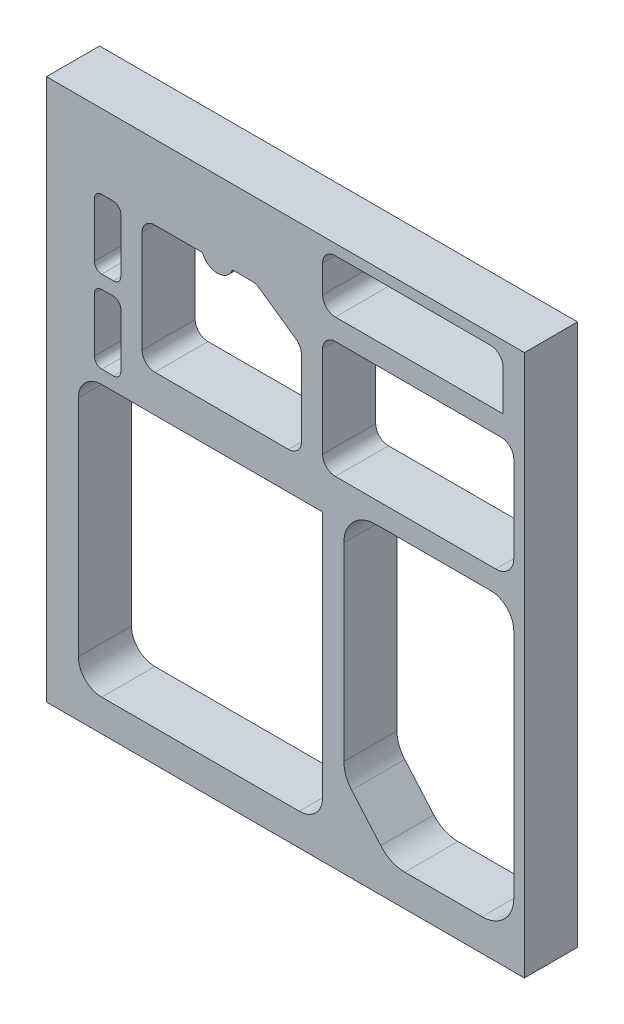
ISO-10303-21;
HEADER;
FILE_DESCRIPTION(('STEP AP214'),'2;1');
FILE_NAME('part.step','',(''),(''),'','','');
FILE_SCHEMA(('AUTOMOTIVE_DESIGN { 1 0 10303 214 1 1 1 1 }'));
ENDSEC;
DATA;
#1=APPLICATION_CONTEXT('core data for automotive mechanical design processes');
#2=APPLICATION_PROTOCOL_DEFINITION('international standard','automotive_design',2000,#1);
#3=PRODUCT_CONTEXT('',#1,'mechanical');
#4=PRODUCT('Part','Part','',(#3));
#5=PRODUCT_RELATED_PRODUCT_CATEGORY('part','',(#4));
#6=PRODUCT_DEFINITION_FORMATION('','',#4);
#7=PRODUCT_DEFINITION_CONTEXT('part definition',#1,'design');
#8=PRODUCT_DEFINITION('design','',#6,#7);
#9=PRODUCT_DEFINITION_SHAPE('','',#8);
#10=(LENGTH_UNIT() NAMED_UNIT(*) SI_UNIT(.MILLI.,.METRE.));
#11=(NAMED_UNIT(*) PLANE_ANGLE_UNIT() SI_UNIT($,.RADIAN.));
#12=(NAMED_UNIT(*) SI_UNIT($,.STERADIAN.) SOLID_ANGLE_UNIT());
#13=UNCERTAINTY_MEASURE_WITH_UNIT(LENGTH_MEASURE(1.E-05),#10,'distance_accuracy_value','');
#14=(GEOMETRIC_REPRESENTATION_CONTEXT(3) GLOBAL_UNCERTAINTY_ASSIGNED_CONTEXT((#13)) GLOBAL_UNIT_ASSIGNED_CONTEXT((#10,
#11,#12)) REPRESENTATION_CONTEXT('',''));
#15=CARTESIAN_POINT('',(0.,0.,0.));
#16=DIRECTION('',(0.,0.,1.));
#17=DIRECTION('',(1.,0.,0.));
#18=AXIS2_PLACEMENT_3D('',#15,#16,#17);
#19=CARTESIAN_POINT('',(0.,0.,0.));
#20=DIRECTION('',(0.,0.,-1.));
#21=DIRECTION('',(-1.,0.,0.));
#22=AXIS2_PLACEMENT_3D('',#19,#20,#21);
#23=PLANE('',#22);
#24=DIRECTION('',(0.,-1.,0.));
#25=VECTOR('',#24,1.);
#26=CARTESIAN_POINT('',(-19.0500000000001,-19.05,0.));
#27=LINE('',#26,#25);
#28=CARTESIAN_POINT('',(-19.0500000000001,304.8,0.));
#29=VERTEX_POINT('',#28);
#30=CARTESIAN_POINT('',(-19.0500000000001,-19.05,0.));
#31=VERTEX_POINT('',#30);
#32=EDGE_CURVE('E354',#29,#31,#27,.T.);
#33=ORIENTED_EDGE('',*,*,#32,.F.);
#34=DIRECTION('',(-1.,0.,0.));
#35=VECTOR('',#34,1.);
#36=CARTESIAN_POINT('',(-19.0500000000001,304.8,0.));
#37=LINE('',#36,#35);
#38=CARTESIAN_POINT('',(266.7,304.8,0.));
#39=VERTEX_POINT('',#38);
#40=EDGE_CURVE('E349',#39,#29,#37,.T.);
#41=ORIENTED_EDGE('',*,*,#40,.F.);
#42=DIRECTION('',(0.,1.,0.));
#43=VECTOR('',#42,1.);
#44=CARTESIAN_POINT('',(266.7,-19.05,0.));
#45=LINE('',#44,#43);
#46=CARTESIAN_POINT('',(266.7,-19.05,0.));
#47=VERTEX_POINT('',#46);
#48=EDGE_CURVE('E344',#47,#39,#45,.T.);
#49=ORIENTED_EDGE('',*,*,#48,.F.);
#50=DIRECTION('',(1.,0.,0.));
#51=VECTOR('',#50,1.);
#52=CARTESIAN_POINT('',(-19.0500000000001,-19.05,0.));
#53=LINE('',#52,#51);
#54=EDGE_CURVE('E339',#31,#47,#53,.T.);
#55=ORIENTED_EDGE('',*,*,#54,.F.);
#56=EDGE_LOOP('',(#33,#41,#49,#55));
#57=FACE_BOUND('',#56,.T.);
#58=DIRECTION('',(0.,1.,0.));
#59=VECTOR('',#58,1.);
#60=CARTESIAN_POINT('',(254.,266.7,0.));
#61=LINE('',#60,#59);
#62=CARTESIAN_POINT('',(254.,266.7,0.));
#63=VERTEX_POINT('',#62);
#64=CARTESIAN_POINT('',(254.,290.83,0.));
#65=VERTEX_POINT('',#64);
#66=EDGE_CURVE('E928',#63,#65,#61,.T.);
#67=ORIENTED_EDGE('',*,*,#66,.T.);
#68=CARTESIAN_POINT('',(246.38,290.83,0.));
#69=DIRECTION('',(0.,0.,1.));
#70=DIRECTION('',(1.,0.,0.));
#71=AXIS2_PLACEMENT_3D('',#68,#69,#70);
#72=CIRCLE('',#71,7.61999999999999);
#73=CARTESIAN_POINT('',(246.38,298.45,0.));
#74=VERTEX_POINT('',#73);
#75=EDGE_CURVE('E932',#65,#74,#72,.T.);
#76=ORIENTED_EDGE('',*,*,#75,.T.);
#77=DIRECTION('',(-1.,0.,0.));
#78=VECTOR('',#77,1.);
#79=CARTESIAN_POINT('',(246.38,298.45,0.));
#80=LINE('',#79,#78);
#81=CARTESIAN_POINT('',(153.67,298.45,0.));
#82=VERTEX_POINT('',#81);
#83=EDGE_CURVE('E950',#74,#82,#80,.T.);
#84=ORIENTED_EDGE('',*,*,#83,.T.);
#85=CARTESIAN_POINT('',(153.67,290.83,0.));
#86=DIRECTION('',(0.,0.,1.));
#87=DIRECTION('',(1.,0.,0.));
#88=AXIS2_PLACEMENT_3D('',#85,#86,#87);
#89=CIRCLE('',#88,7.62);
#90=CARTESIAN_POINT('',(146.05,290.83,0.));
#91=VERTEX_POINT('',#90);
#92=EDGE_CURVE('E946',#82,#91,#89,.T.);
#93=ORIENTED_EDGE('',*,*,#92,.T.);
#94=DIRECTION('',(0.,-1.,0.));
#95=VECTOR('',#94,1.);
#96=CARTESIAN_POINT('',(146.05,290.83,0.));
#97=LINE('',#96,#95);
#98=CARTESIAN_POINT('',(146.05,274.32,0.));
#99=VERTEX_POINT('',#98);
#100=EDGE_CURVE('E942',#91,#99,#97,.T.);
#101=ORIENTED_EDGE('',*,*,#100,.T.);
#102=CARTESIAN_POINT('',(153.67,274.32,0.));
#103=DIRECTION('',(0.,0.,1.));
#104=DIRECTION('',(1.,0.,0.));
#105=AXIS2_PLACEMENT_3D('',#102,#103,#104);
#106=CIRCLE('',#105,7.61999999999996);
#107=CARTESIAN_POINT('',(153.67,266.7,0.));
#108=VERTEX_POINT('',#107);
#109=EDGE_CURVE('E938',#99,#108,#106,.T.);
#110=ORIENTED_EDGE('',*,*,#109,.T.);
#111=DIRECTION('',(1.,0.,0.));
#112=VECTOR('',#111,1.);
#113=CARTESIAN_POINT('',(181.8005,266.7,0.));
#114=LINE('',#113,#112);
#115=EDGE_CURVE('E933',#108,#63,#114,.T.);
#116=ORIENTED_EDGE('',*,*,#115,.T.);
#117=EDGE_LOOP('',(#67,#76,#84,#93,#101,#110,#116));
#118=FACE_BOUND('',#117,.T.);
#119=DIRECTION('',(1.,0.,0.));
#120=VECTOR('',#119,1.);
#121=CARTESIAN_POINT('',(13.9699999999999,0.,0.));
#122=LINE('',#121,#120);
#123=CARTESIAN_POINT('',(13.9699999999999,0.,0.));
#124=VERTEX_POINT('',#123);
#125=CARTESIAN_POINT('',(132.08,0.,0.));
#126=VERTEX_POINT('',#125);
#127=EDGE_CURVE('E937',#124,#126,#122,.T.);
#128=ORIENTED_EDGE('',*,*,#127,.T.);
#129=CARTESIAN_POINT('',(132.08,13.97,0.));
#130=DIRECTION('',(0.,0.,1.));
#131=DIRECTION('',(1.,0.,0.));
#132=AXIS2_PLACEMENT_3D('',#129,#130,#131);
#133=CIRCLE('',#132,13.97);
#134=CARTESIAN_POINT('',(146.05,13.97,0.));
#135=VERTEX_POINT('',#134);
#136=EDGE_CURVE('E960',#126,#135,#133,.T.);
#137=ORIENTED_EDGE('',*,*,#136,.T.);
#138=DIRECTION('',(0.,1.,0.));
#139=VECTOR('',#138,1.);
#140=CARTESIAN_POINT('',(146.05,13.97,0.));
#141=LINE('',#140,#139);
#142=CARTESIAN_POINT('',(146.05,161.925,0.));
#143=VERTEX_POINT('',#142);
#144=EDGE_CURVE('E978',#135,#143,#141,.T.);
#145=ORIENTED_EDGE('',*,*,#144,.T.);
#146=DIRECTION('',(-1.,0.,0.));
#147=VECTOR('',#146,1.);
#148=CARTESIAN_POINT('',(146.05,161.925,0.));
#149=LINE('',#148,#147);
#150=CARTESIAN_POINT('',(13.97,161.925,0.));
#151=VERTEX_POINT('',#150);
#152=EDGE_CURVE('E974',#143,#151,#149,.T.);
#153=ORIENTED_EDGE('',*,*,#152,.T.);
#154=CARTESIAN_POINT('',(13.97,147.955,0.));
#155=DIRECTION('',(0.,0.,1.));
#156=DIRECTION('',(1.,0.,0.));
#157=AXIS2_PLACEMENT_3D('',#154,#155,#156);
#158=CIRCLE('',#157,13.97);
#159=CARTESIAN_POINT('',(0.,147.955,0.));
#160=VERTEX_POINT('',#159);
#161=EDGE_CURVE('E970',#151,#160,#158,.T.);
#162=ORIENTED_EDGE('',*,*,#161,.T.);
#163=DIRECTION('',(0.,-1.,0.));
#164=VECTOR('',#163,1.);
#165=CARTESIAN_POINT('',(0.,147.955,0.));
#166=LINE('',#165,#164);
#167=CARTESIAN_POINT('',(0.,13.97,0.));
#168=VERTEX_POINT('',#167);
#169=EDGE_CURVE('E966',#160,#168,#166,.T.);
#170=ORIENTED_EDGE('',*,*,#169,.T.);
#171=CARTESIAN_POINT('',(13.97,13.97,0.));
#172=DIRECTION('',(0.,0.,1.));
#173=DIRECTION('',(1.,0.,0.));
#174=AXIS2_PLACEMENT_3D('',#171,#172,#173);
#175=CIRCLE('',#174,13.97);
#176=EDGE_CURVE('E961',#168,#124,#175,.T.);
#177=ORIENTED_EDGE('',*,*,#176,.T.);
#178=EDGE_LOOP('',(#128,#137,#145,#153,#162,#170,#177));
#179=FACE_BOUND('',#178,.T.);
#180=DIRECTION('',(-1.,0.,0.));
#181=VECTOR('',#180,1.);
#182=CARTESIAN_POINT('',(246.38,171.45,0.));
#183=LINE('',#182,#181);
#184=CARTESIAN_POINT('',(246.38,171.45,0.));
#185=VERTEX_POINT('',#184);
#186=CARTESIAN_POINT('',(177.8,171.45,0.));
#187=VERTEX_POINT('',#186);
#188=EDGE_CURVE('E965',#185,#187,#183,.T.);
#189=ORIENTED_EDGE('',*,*,#188,.T.);
#190=CARTESIAN_POINT('',(177.8,152.4,0.));
#191=DIRECTION('',(0.,0.,1.));
#192=DIRECTION('',(1.,0.,0.));
#193=AXIS2_PLACEMENT_3D('',#190,#191,#192);
#194=CIRCLE('',#193,19.05);
#195=CARTESIAN_POINT('',(158.75,152.4,0.));
#196=VERTEX_POINT('',#195);
#197=EDGE_CURVE('E988',#187,#196,#194,.T.);
#198=ORIENTED_EDGE('',*,*,#197,.T.);
#199=DIRECTION('',(0.,-1.,0.));
#200=VECTOR('',#199,1.);
#201=CARTESIAN_POINT('',(158.75,152.4,0.));
#202=LINE('',#201,#200);
#203=CARTESIAN_POINT('',(158.75,39.0592430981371,0.));
#204=VERTEX_POINT('',#203);
#205=EDGE_CURVE('E1018',#196,#204,#202,.T.);
#206=ORIENTED_EDGE('',*,*,#205,.T.);
#207=CARTESIAN_POINT('',(177.8,39.0592430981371,0.));
#208=DIRECTION('',(0.,0.,1.));
#209=DIRECTION('',(1.,0.,0.));
#210=AXIS2_PLACEMENT_3D('',#207,#208,#209);
#211=CIRCLE('',#210,19.05);
#212=CARTESIAN_POINT('',(163.416676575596,26.5683461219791,0.));
#213=VERTEX_POINT('',#212);
#214=EDGE_CURVE('E1014',#204,#213,#211,.T.);
#215=ORIENTED_EDGE('',*,*,#214,.T.);
#216=DIRECTION('',(0.655690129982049,-0.755030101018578,0.));
#217=VECTOR('',#216,1.);
#218=CARTESIAN_POINT('',(163.416676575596,26.5683461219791,0.));
#219=LINE('',#218,#217);
#220=CARTESIAN_POINT('',(180.793286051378,6.559103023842,0.));
#221=VERTEX_POINT('',#220);
#222=EDGE_CURVE('E1010',#213,#221,#219,.T.);
#223=ORIENTED_EDGE('',*,*,#222,.T.);
#224=CARTESIAN_POINT('',(195.176609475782,19.05,0.));
#225=DIRECTION('',(0.,0.,1.));
#226=DIRECTION('',(1.,0.,0.));
#227=AXIS2_PLACEMENT_3D('',#224,#225,#226);
#228=CIRCLE('',#227,19.0500000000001);
#229=CARTESIAN_POINT('',(195.176609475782,0.,0.));
#230=VERTEX_POINT('',#229);
#231=EDGE_CURVE('E1006',#221,#230,#228,.T.);
#232=ORIENTED_EDGE('',*,*,#231,.T.);
#233=DIRECTION('',(1.,0.,0.));
#234=VECTOR('',#233,1.);
#235=CARTESIAN_POINT('',(195.176609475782,0.,0.));
#236=LINE('',#235,#234);
#237=CARTESIAN_POINT('',(241.3,0.,0.));
#238=VERTEX_POINT('',#237);
#239=EDGE_CURVE('E1002',#230,#238,#236,.T.);
#240=ORIENTED_EDGE('',*,*,#239,.T.);
#241=CARTESIAN_POINT('',(241.3,19.05,0.));
#242=DIRECTION('',(0.,0.,1.));
#243=DIRECTION('',(1.,0.,0.));
#244=AXIS2_PLACEMENT_3D('',#241,#242,#243);
#245=CIRCLE('',#244,19.05);
#246=CARTESIAN_POINT('',(260.35,19.05,0.));
#247=VERTEX_POINT('',#246);
#248=EDGE_CURVE('E998',#238,#247,#245,.T.);
#249=ORIENTED_EDGE('',*,*,#248,.T.);
#250=DIRECTION('',(0.,1.,0.));
#251=VECTOR('',#250,1.);
#252=CARTESIAN_POINT('',(260.35,19.05,0.));
#253=LINE('',#252,#251);
#254=CARTESIAN_POINT('',(260.35,157.48,0.));
#255=VERTEX_POINT('',#254);
#256=EDGE_CURVE('E994',#247,#255,#253,.T.);
#257=ORIENTED_EDGE('',*,*,#256,.T.);
#258=CARTESIAN_POINT('',(246.38,157.48,0.));
#259=DIRECTION('',(0.,0.,1.));
#260=DIRECTION('',(1.,0.,0.));
#261=AXIS2_PLACEMENT_3D('',#258,#259,#260);
#262=CIRCLE('',#261,13.97);
#263=EDGE_CURVE('E989',#255,#185,#262,.T.);
#264=ORIENTED_EDGE('',*,*,#263,.T.);
#265=EDGE_LOOP('',(#189,#198,#206,#215,#223,#232,#240,#249,#257,#264));
#266=FACE_BOUND('',#265,.T.);
#267=DIRECTION('',(0.,1.,0.));
#268=VECTOR('',#267,1.);
#269=CARTESIAN_POINT('',(260.35,194.945,0.));
#270=LINE('',#269,#268);
#271=CARTESIAN_POINT('',(260.35,194.945,0.));
#272=VERTEX_POINT('',#271);
#273=CARTESIAN_POINT('',(260.35,246.38,0.));
#274=VERTEX_POINT('',#273);
#275=EDGE_CURVE('E993',#272,#274,#270,.T.);
#276=ORIENTED_EDGE('',*,*,#275,.T.);
#277=CARTESIAN_POINT('',(252.73,246.38,0.));
#278=DIRECTION('',(0.,0.,1.));
#279=DIRECTION('',(1.,0.,0.));
#280=AXIS2_PLACEMENT_3D('',#277,#278,#279);
#281=CIRCLE('',#280,7.62000000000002);
#282=CARTESIAN_POINT('',(252.73,254.,0.));
#283=VERTEX_POINT('',#282);
#284=EDGE_CURVE('E1028',#274,#283,#281,.T.);
#285=ORIENTED_EDGE('',*,*,#284,.T.);
#286=DIRECTION('',(-1.,0.,0.));
#287=VECTOR('',#286,1.);
#288=CARTESIAN_POINT('',(252.73,254.,0.));
#289=LINE('',#288,#287);
#290=CARTESIAN_POINT('',(153.67,254.,0.));
#291=VERTEX_POINT('',#290);
#292=EDGE_CURVE('E1050',#283,#291,#289,.T.);
#293=ORIENTED_EDGE('',*,*,#292,.T.);
#294=CARTESIAN_POINT('',(153.67,246.38,0.));
#295=DIRECTION('',(0.,0.,1.));
#296=DIRECTION('',(1.,0.,0.));
#297=AXIS2_PLACEMENT_3D('',#294,#295,#296);
#298=CIRCLE('',#297,7.62);
#299=CARTESIAN_POINT('',(146.05,246.38,0.));
#300=VERTEX_POINT('',#299);
#301=EDGE_CURVE('E1046',#291,#300,#298,.T.);
#302=ORIENTED_EDGE('',*,*,#301,.T.);
#303=DIRECTION('',(0.,-1.,0.));
#304=VECTOR('',#303,1.);
#305=CARTESIAN_POINT('',(146.05,246.38,0.));
#306=LINE('',#305,#304);
#307=CARTESIAN_POINT('',(146.05,191.77,0.));
#308=VERTEX_POINT('',#307);
#309=EDGE_CURVE('E1042',#300,#308,#306,.T.);
#310=ORIENTED_EDGE('',*,*,#309,.T.);
#311=CARTESIAN_POINT('',(153.67,191.77,0.));
#312=DIRECTION('',(0.,0.,1.));
#313=DIRECTION('',(1.,0.,0.));
#314=AXIS2_PLACEMENT_3D('',#311,#312,#313);
#315=CIRCLE('',#314,7.61999999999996);
#316=CARTESIAN_POINT('',(153.67,184.15,0.));
#317=VERTEX_POINT('',#316);
#318=EDGE_CURVE('E1038',#308,#317,#315,.T.);
#319=ORIENTED_EDGE('',*,*,#318,.T.);
#320=DIRECTION('',(1.,0.,0.));
#321=VECTOR('',#320,1.);
#322=CARTESIAN_POINT('',(153.67,184.15,0.));
#323=LINE('',#322,#321);
#324=CARTESIAN_POINT('',(249.555,184.15,0.));
#325=VERTEX_POINT('',#324);
#326=EDGE_CURVE('E1034',#317,#325,#323,.T.);
#327=ORIENTED_EDGE('',*,*,#326,.T.);
#328=CARTESIAN_POINT('',(249.555,194.945,0.));
#329=DIRECTION('',(0.,0.,1.));
#330=DIRECTION('',(1.,0.,0.));
#331=AXIS2_PLACEMENT_3D('',#328,#329,#330);
#332=CIRCLE('',#331,10.795);
#333=EDGE_CURVE('E1029',#325,#272,#332,.T.);
#334=ORIENTED_EDGE('',*,*,#333,.T.);
#335=EDGE_LOOP('',(#276,#285,#293,#302,#310,#319,#327,#334));
#336=FACE_BOUND('',#335,.T.);
#337=DIRECTION('',(-1.,0.,0.));
#338=VECTOR('',#337,1.);
#339=CARTESIAN_POINT('',(103.688719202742,260.35,0.));
#340=LINE('',#339,#338);
#341=CARTESIAN_POINT('',(103.688719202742,260.35,0.));
#342=VERTEX_POINT('',#341);
#343=CARTESIAN_POINT('',(92.1328778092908,260.35,0.));
#344=VERTEX_POINT('',#343);
#345=EDGE_CURVE('E1033',#342,#344,#340,.T.);
#346=ORIENTED_EDGE('',*,*,#345,.T.);
#347=CARTESIAN_POINT('',(83.185,263.652,0.));
#348=DIRECTION('',(0.,0.,-1.));
#349=DIRECTION('',(1.,0.,0.));
#350=AXIS2_PLACEMENT_3D('',#347,#348,#349);
#351=CIRCLE('',#350,9.5377);
#352=CARTESIAN_POINT('',(74.2371221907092,260.35,0.));
#353=VERTEX_POINT('',#352);
#354=EDGE_CURVE('E1060',#344,#353,#351,.T.);
#355=ORIENTED_EDGE('',*,*,#354,.T.);
#356=DIRECTION('',(-1.,0.,0.));
#357=VECTOR('',#356,1.);
#358=CARTESIAN_POINT('',(74.2371221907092,260.35,0.));
#359=LINE('',#358,#357);
#360=CARTESIAN_POINT('',(45.72,260.35,0.));
#361=VERTEX_POINT('',#360);
#362=EDGE_CURVE('E1098',#353,#361,#359,.T.);
#363=ORIENTED_EDGE('',*,*,#362,.T.);
#364=CARTESIAN_POINT('',(45.72,252.73,0.));
#365=DIRECTION('',(0.,0.,1.));
#366=DIRECTION('',(1.,0.,0.));
#367=AXIS2_PLACEMENT_3D('',#364,#365,#366);
#368=CIRCLE('',#367,7.61999999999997);
#369=CARTESIAN_POINT('',(38.1,252.73,0.));
#370=VERTEX_POINT('',#369);
#371=EDGE_CURVE('E1094',#361,#370,#368,.T.);
#372=ORIENTED_EDGE('',*,*,#371,.T.);
#373=DIRECTION('',(0.,-1.,0.));
#374=VECTOR('',#373,1.);
#375=CARTESIAN_POINT('',(38.1,252.73,0.));
#376=LINE('',#375,#374);
#377=CARTESIAN_POINT('',(38.1,191.77,0.));
#378=VERTEX_POINT('',#377);
#379=EDGE_CURVE('E1090',#370,#378,#376,.T.);
#380=ORIENTED_EDGE('',*,*,#379,.T.);
#381=CARTESIAN_POINT('',(45.72,191.77,0.));
#382=DIRECTION('',(0.,0.,1.));
#383=DIRECTION('',(1.,0.,0.));
#384=AXIS2_PLACEMENT_3D('',#381,#382,#383);
#385=CIRCLE('',#384,7.61999999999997);
#386=CARTESIAN_POINT('',(45.72,184.15,0.));
#387=VERTEX_POINT('',#386);
#388=EDGE_CURVE('E1086',#378,#387,#385,.T.);
#389=ORIENTED_EDGE('',*,*,#388,.T.);
#390=DIRECTION('',(1.,0.,0.));
#391=VECTOR('',#390,1.);
#392=CARTESIAN_POINT('',(45.72,184.15,0.));
#393=LINE('',#392,#391);
#394=CARTESIAN_POINT('',(125.73,184.15,0.));
#395=VERTEX_POINT('',#394);
#396=EDGE_CURVE('E1082',#387,#395,#393,.T.);
#397=ORIENTED_EDGE('',*,*,#396,.T.);
#398=CARTESIAN_POINT('',(125.73,191.77,0.));
#399=DIRECTION('',(0.,0.,1.));
#400=DIRECTION('',(1.,0.,0.));
#401=AXIS2_PLACEMENT_3D('',#398,#399,#400);
#402=CIRCLE('',#401,7.61999999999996);
#403=CARTESIAN_POINT('',(133.35,191.77,0.));
#404=VERTEX_POINT('',#403);
#405=EDGE_CURVE('E1078',#395,#404,#402,.T.);
#406=ORIENTED_EDGE('',*,*,#405,.T.);
#407=DIRECTION('',(0.,1.,0.));
#408=VECTOR('',#407,1.);
#409=CARTESIAN_POINT('',(133.35,191.77,0.));
#410=LINE('',#409,#408);
#411=CARTESIAN_POINT('',(133.35,237.296529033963,0.));
#412=VERTEX_POINT('',#411);
#413=EDGE_CURVE('E1074',#404,#412,#410,.T.);
#414=ORIENTED_EDGE('',*,*,#413,.T.);
#415=CARTESIAN_POINT('',(125.73,237.296529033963,0.));
#416=DIRECTION('',(0.,0.,1.));
#417=DIRECTION('',(1.,0.,0.));
#418=AXIS2_PLACEMENT_3D('',#415,#416,#417);
#419=CIRCLE('',#418,7.6200000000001);
#420=CARTESIAN_POINT('',(130.100652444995,243.538467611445,0.));
#421=VERTEX_POINT('',#420);
#422=EDGE_CURVE('E1070',#412,#421,#419,.T.);
#423=ORIENTED_EDGE('',*,*,#422,.T.);
#424=DIRECTION('',(-0.819152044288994,0.573576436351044,0.));
#425=VECTOR('',#424,1.);
#426=CARTESIAN_POINT('',(130.100652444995,243.538467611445,0.));
#427=LINE('',#426,#425);
#428=CARTESIAN_POINT('',(108.059371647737,258.971938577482,0.));
#429=VERTEX_POINT('',#428);
#430=EDGE_CURVE('E1066',#421,#429,#427,.T.);
#431=ORIENTED_EDGE('',*,*,#430,.T.);
#432=CARTESIAN_POINT('',(103.688719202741,252.73,0.));
#433=DIRECTION('',(0.,0.,1.));
#434=DIRECTION('',(1.,0.,0.));
#435=AXIS2_PLACEMENT_3D('',#432,#433,#434);
#436=CIRCLE('',#435,7.62000000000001);
#437=EDGE_CURVE('E1061',#429,#342,#436,.T.);
#438=ORIENTED_EDGE('',*,*,#437,.T.);
#439=EDGE_LOOP('',(#346,#355,#363,#372,#380,#389,#397,#406,#414,#423,#431,#438));
#440=FACE_BOUND('',#439,.T.);
#441=DIRECTION('',(0.,1.,0.));
#442=VECTOR('',#441,1.);
#443=CARTESIAN_POINT('',(25.4,174.3075,0.));
#444=LINE('',#443,#442);
#445=CARTESIAN_POINT('',(25.4,174.3075,0.));
#446=VERTEX_POINT('',#445);
#447=CARTESIAN_POINT('',(25.4,206.6925,0.));
#448=VERTEX_POINT('',#447);
#449=EDGE_CURVE('E1065',#446,#448,#444,.T.);
#450=ORIENTED_EDGE('',*,*,#449,.T.);
#451=CARTESIAN_POINT('',(20.955,206.6925,0.));
#452=DIRECTION('',(0.,0.,1.));
#453=DIRECTION('',(1.,0.,0.));
#454=AXIS2_PLACEMENT_3D('',#451,#452,#453);
#455=CIRCLE('',#454,4.44500000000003);
#456=CARTESIAN_POINT('',(20.955,211.1375,0.));
#457=VERTEX_POINT('',#456);
#458=EDGE_CURVE('E1108',#448,#457,#455,.T.);
#459=ORIENTED_EDGE('',*,*,#458,.T.);
#460=DIRECTION('',(-1.,0.,0.));
#461=VECTOR('',#460,1.);
#462=CARTESIAN_POINT('',(20.955,211.1375,0.));
#463=LINE('',#462,#461);
#464=CARTESIAN_POINT('',(13.97,211.1375,0.));
#465=VERTEX_POINT('',#464);
#466=EDGE_CURVE('E1128',#457,#465,#463,.T.);
#467=ORIENTED_EDGE('',*,*,#466,.T.);
#468=CARTESIAN_POINT('',(13.97,206.6925,0.));
#469=DIRECTION('',(0.,0.,1.));
#470=DIRECTION('',(1.,0.,0.));
#471=AXIS2_PLACEMENT_3D('',#468,#469,#470);
#472=CIRCLE('',#471,4.44500000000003);
#473=CARTESIAN_POINT('',(9.52499999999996,206.6925,0.));
#474=VERTEX_POINT('',#473);
#475=EDGE_CURVE('E1124',#465,#474,#472,.T.);
#476=ORIENTED_EDGE('',*,*,#475,.T.);
#477=DIRECTION('',(0.,-1.,0.));
#478=VECTOR('',#477,1.);
#479=CARTESIAN_POINT('',(9.52499999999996,206.6925,0.));
#480=LINE('',#479,#478);
#481=CARTESIAN_POINT('',(9.52499999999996,174.3075,0.));
#482=VERTEX_POINT('',#481);
#483=EDGE_CURVE('E1120',#474,#482,#480,.T.);
#484=ORIENTED_EDGE('',*,*,#483,.T.);
#485=CARTESIAN_POINT('',(13.97,174.3075,0.));
#486=DIRECTION('',(0.,0.,1.));
#487=DIRECTION('',(1.,0.,0.));
#488=AXIS2_PLACEMENT_3D('',#485,#486,#487);
#489=CIRCLE('',#488,4.44500000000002);
#490=CARTESIAN_POINT('',(13.97,169.8625,0.));
#491=VERTEX_POINT('',#490);
#492=EDGE_CURVE('E1116',#482,#491,#489,.T.);
#493=ORIENTED_EDGE('',*,*,#492,.T.);
#494=DIRECTION('',(1.,0.,0.));
#495=VECTOR('',#494,1.);
#496=CARTESIAN_POINT('',(13.97,169.8625,0.));
#497=LINE('',#496,#495);
#498=CARTESIAN_POINT('',(20.955,169.8625,0.));
#499=VERTEX_POINT('',#498);
#500=EDGE_CURVE('E1112',#491,#499,#497,.T.);
#501=ORIENTED_EDGE('',*,*,#500,.T.);
#502=CARTESIAN_POINT('',(20.955,174.3075,0.));
#503=DIRECTION('',(0.,0.,1.));
#504=DIRECTION('',(1.,0.,0.));
#505=AXIS2_PLACEMENT_3D('',#502,#503,#504);
#506=CIRCLE('',#505,4.44500000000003);
#507=EDGE_CURVE('E328',#499,#446,#506,.T.);
#508=ORIENTED_EDGE('',*,*,#507,.T.);
#509=EDGE_LOOP('',(#450,#459,#467,#476,#484,#493,#501,#508));
#510=FACE_BOUND('',#509,.T.);
#511=DIRECTION('',(0.,1.,0.));
#512=VECTOR('',#511,1.);
#513=CARTESIAN_POINT('',(25.4,223.52,0.));
#514=LINE('',#513,#512);
#515=CARTESIAN_POINT('',(25.4,223.52,0.));
#516=VERTEX_POINT('',#515);
#517=CARTESIAN_POINT('',(25.4,255.905,0.));
#518=VERTEX_POINT('',#517);
#519=EDGE_CURVE('E323',#516,#518,#514,.T.);
#520=ORIENTED_EDGE('',*,*,#519,.T.);
#521=CARTESIAN_POINT('',(20.955,255.905,0.));
#522=DIRECTION('',(0.,0.,1.));
#523=DIRECTION('',(1.,0.,0.));
#524=AXIS2_PLACEMENT_3D('',#521,#522,#523);
#525=CIRCLE('',#524,4.44500000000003);
#526=CARTESIAN_POINT('',(20.9549999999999,260.35,0.));
#527=VERTEX_POINT('',#526);
#528=EDGE_CURVE('E307',#518,#527,#525,.T.);
#529=ORIENTED_EDGE('',*,*,#528,.T.);
#530=DIRECTION('',(-1.,0.,0.));
#531=VECTOR('',#530,1.);
#532=CARTESIAN_POINT('',(20.9549999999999,260.35,0.));
#533=LINE('',#532,#531);
#534=CARTESIAN_POINT('',(13.97,260.35,0.));
#535=VERTEX_POINT('',#534);
#536=EDGE_CURVE('E314',#527,#535,#533,.T.);
#537=ORIENTED_EDGE('',*,*,#536,.T.);
#538=CARTESIAN_POINT('',(13.97,255.905,0.));
#539=DIRECTION('',(0.,0.,1.));
#540=DIRECTION('',(1.,0.,0.));
#541=AXIS2_PLACEMENT_3D('',#538,#539,#540);
#542=CIRCLE('',#541,4.44500000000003);
#543=CARTESIAN_POINT('',(9.52499999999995,255.905,0.));
#544=VERTEX_POINT('',#543);
#545=EDGE_CURVE('E319',#535,#544,#542,.T.);
#546=ORIENTED_EDGE('',*,*,#545,.T.);
#547=DIRECTION('',(0.,-1.,0.));
#548=VECTOR('',#547,1.);
#549=CARTESIAN_POINT('',(9.52499999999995,255.905,0.));
#550=LINE('',#549,#548);
#551=CARTESIAN_POINT('',(9.52499999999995,223.52,0.));
#552=VERTEX_POINT('',#551);
#553=EDGE_CURVE('E792',#544,#552,#550,.T.);
#554=ORIENTED_EDGE('',*,*,#553,.T.);
#555=CARTESIAN_POINT('',(13.97,223.52,0.));
#556=DIRECTION('',(0.,0.,1.));
#557=DIRECTION('',(1.,0.,0.));
#558=AXIS2_PLACEMENT_3D('',#555,#556,#557);
#559=CIRCLE('',#558,4.44500000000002);
#560=CARTESIAN_POINT('',(13.97,219.075,0.));
#561=VERTEX_POINT('',#560);
#562=EDGE_CURVE('E787',#552,#561,#559,.T.);
#563=ORIENTED_EDGE('',*,*,#562,.T.);
#564=DIRECTION('',(1.,0.,0.));
#565=VECTOR('',#564,1.);
#566=CARTESIAN_POINT('',(13.97,219.075,0.));
#567=LINE('',#566,#565);
#568=CARTESIAN_POINT('',(20.9549999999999,219.075,0.));
#569=VERTEX_POINT('',#568);
#570=EDGE_CURVE('E782',#561,#569,#567,.T.);
#571=ORIENTED_EDGE('',*,*,#570,.T.);
#572=CARTESIAN_POINT('',(20.955,223.52,0.));
#573=DIRECTION('',(0.,0.,1.));
#574=DIRECTION('',(1.,0.,0.));
#575=AXIS2_PLACEMENT_3D('',#572,#573,#574);
#576=CIRCLE('',#575,4.44500000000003);
#577=EDGE_CURVE('E532',#569,#516,#576,.T.);
#578=ORIENTED_EDGE('',*,*,#577,.T.);
#579=EDGE_LOOP('',(#520,#529,#537,#546,#554,#563,#571,#578));
#580=FACE_BOUND('',#579,.T.);
#581=ADVANCED_FACE('F41',(#57,#118,#179,#266,#336,#440,#510,#580),#23,.T.);
#582=CARTESIAN_POINT('',(-19.0500000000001,-19.05,463.643372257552));
#583=DIRECTION('',(1.,0.,0.));
#584=DIRECTION('',(0.,1.,0.));
#585=AXIS2_PLACEMENT_3D('',#582,#583,#584);
#586=PLANE('',#585);
#587=DIRECTION('',(0.,0.,-1.));
#588=VECTOR('',#587,1.);
#589=CARTESIAN_POINT('',(-19.0500000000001,-19.05,463.643372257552));
#590=LINE('',#589,#588);
#591=CARTESIAN_POINT('',(-19.0500000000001,-19.05,31.75));
#592=VERTEX_POINT('',#591);
#593=EDGE_CURVE('E336',#592,#31,#590,.T.);
#594=ORIENTED_EDGE('',*,*,#593,.F.);
#595=DIRECTION('',(0.,1.,0.));
#596=VECTOR('',#595,1.);
#597=CARTESIAN_POINT('',(-19.0500000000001,-19.05,31.75));
#598=LINE('',#597,#596);
#599=CARTESIAN_POINT('',(-19.0500000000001,304.8,31.75));
#600=VERTEX_POINT('',#599);
#601=EDGE_CURVE('E61',#592,#600,#598,.T.);
#602=ORIENTED_EDGE('',*,*,#601,.T.);
#603=DIRECTION('',(0.,0.,-1.));
#604=VECTOR('',#603,1.);
#605=CARTESIAN_POINT('',(-19.0500000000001,304.8,463.643372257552));
#606=LINE('',#605,#604);
#607=EDGE_CURVE('E351',#600,#29,#606,.T.);
#608=ORIENTED_EDGE('',*,*,#607,.T.);
#609=ORIENTED_EDGE('',*,*,#32,.T.);
#610=EDGE_LOOP('',(#594,#602,#608,#609));
#611=FACE_BOUND('',#610,.T.);
#612=ADVANCED_FACE('F915',(#611),#586,.F.);
#613=CARTESIAN_POINT('',(-19.0500000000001,-19.05,463.643372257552));
#614=DIRECTION('',(0.,1.,0.));
#615=DIRECTION('',(0.,0.,1.));
#616=AXIS2_PLACEMENT_3D('',#613,#614,#615);
#617=PLANE('',#616);
#618=DIRECTION('',(0.,0.,-1.));
#619=VECTOR('',#618,1.);
#620=CARTESIAN_POINT('',(266.7,-19.05,463.643372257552));
#621=LINE('',#620,#619);
#622=CARTESIAN_POINT('',(266.7,-19.05,31.75));
#623=VERTEX_POINT('',#622);
#624=EDGE_CURVE('E341',#623,#47,#621,.T.);
#625=ORIENTED_EDGE('',*,*,#624,.F.);
#626=DIRECTION('',(-1.,0.,0.));
#627=VECTOR('',#626,1.);
#628=CARTESIAN_POINT('',(-19.0500000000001,-19.05,31.75));
#629=LINE('',#628,#627);
#630=EDGE_CURVE('E340',#623,#592,#629,.T.);
#631=ORIENTED_EDGE('',*,*,#630,.T.);
#632=ORIENTED_EDGE('',*,*,#593,.T.);
#633=ORIENTED_EDGE('',*,*,#54,.T.);
#634=EDGE_LOOP('',(#625,#631,#632,#633));
#635=FACE_BOUND('',#634,.T.);
#636=ADVANCED_FACE('F903',(#635),#617,.F.);
#637=CARTESIAN_POINT('',(266.7,-19.05,463.643372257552));
#638=DIRECTION('',(-1.,0.,0.));
#639=DIRECTION('',(0.,0.,1.));
#640=AXIS2_PLACEMENT_3D('',#637,#638,#639);
#641=PLANE('',#640);
#642=DIRECTION('',(0.,0.,-1.));
#643=VECTOR('',#642,1.);
#644=CARTESIAN_POINT('',(266.7,304.8,463.643372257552));
#645=LINE('',#644,#643);
#646=CARTESIAN_POINT('',(266.7,304.8,31.75));
#647=VERTEX_POINT('',#646);
#648=EDGE_CURVE('E346',#647,#39,#645,.T.);
#649=ORIENTED_EDGE('',*,*,#648,.F.);
#650=DIRECTION('',(0.,-1.,0.));
#651=VECTOR('',#650,1.);
#652=CARTESIAN_POINT('',(266.7,-19.05,31.75));
#653=LINE('',#652,#651);
#654=EDGE_CURVE('E345',#647,#623,#653,.T.);
#655=ORIENTED_EDGE('',*,*,#654,.T.);
#656=ORIENTED_EDGE('',*,*,#624,.T.);
#657=ORIENTED_EDGE('',*,*,#48,.T.);
#658=EDGE_LOOP('',(#649,#655,#656,#657));
#659=FACE_BOUND('',#658,.T.);
#660=ADVANCED_FACE('F908',(#659),#641,.F.);
#661=CARTESIAN_POINT('',(-19.0500000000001,304.8,463.643372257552));
#662=DIRECTION('',(0.,-1.,0.));
#663=DIRECTION('',(0.,0.,-1.));
#664=AXIS2_PLACEMENT_3D('',#661,#662,#663);
#665=PLANE('',#664);
#666=ORIENTED_EDGE('',*,*,#607,.F.);
#667=DIRECTION('',(1.,0.,0.));
#668=VECTOR('',#667,1.);
#669=CARTESIAN_POINT('',(-19.0500000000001,304.8,31.75));
#670=LINE('',#669,#668);
#671=EDGE_CURVE('E350',#600,#647,#670,.T.);
#672=ORIENTED_EDGE('',*,*,#671,.T.);
#673=ORIENTED_EDGE('',*,*,#648,.T.);
#674=ORIENTED_EDGE('',*,*,#40,.T.);
#675=EDGE_LOOP('',(#666,#672,#673,#674));
#676=FACE_BOUND('',#675,.T.);
#677=ADVANCED_FACE('F913',(#676),#665,.F.);
#678=CARTESIAN_POINT('',(246.38,290.83,463.643372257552));
#679=DIRECTION('',(0.,0.,-1.));
#680=DIRECTION('',(-1.,0.,0.));
#681=AXIS2_PLACEMENT_3D('',#678,#679,#680);
#682=CYLINDRICAL_SURFACE('',#681,7.61999999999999);
#683=CARTESIAN_POINT('',(246.38,290.83,31.75));
#684=DIRECTION('',(0.,0.,-1.));
#685=DIRECTION('',(-1.,0.,0.));
#686=AXIS2_PLACEMENT_3D('',#683,#684,#685);
#687=CIRCLE('',#686,7.61999999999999);
#688=CARTESIAN_POINT('',(246.38,298.45,31.75));
#689=VERTEX_POINT('',#688);
#690=CARTESIAN_POINT('',(254.,290.83,31.75));
#691=VERTEX_POINT('',#690);
#692=EDGE_CURVE('E542',#689,#691,#687,.T.);
#693=ORIENTED_EDGE('',*,*,#692,.F.);
#694=DIRECTION('',(0.,0.,-1.));
#695=VECTOR('',#694,1.);
#696=CARTESIAN_POINT('',(246.38,298.45,463.643372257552));
#697=LINE('',#696,#695);
#698=EDGE_CURVE('E355',#689,#74,#697,.T.);
#699=ORIENTED_EDGE('',*,*,#698,.T.);
#700=ORIENTED_EDGE('',*,*,#75,.F.);
#701=DIRECTION('',(0.,0.,-1.));
#702=VECTOR('',#701,1.);
#703=CARTESIAN_POINT('',(254.,290.83,463.643372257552));
#704=LINE('',#703,#702);
#705=EDGE_CURVE('E373',#691,#65,#704,.T.);
#706=ORIENTED_EDGE('',*,*,#705,.F.);
#707=EDGE_LOOP('',(#693,#699,#700,#706));
#708=FACE_BOUND('',#707,.T.);
#709=ADVANCED_FACE('F1199',(#708),#682,.F.);
#710=CARTESIAN_POINT('',(246.38,298.45,463.643372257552));
#711=DIRECTION('',(0.,-1.,0.));
#712=DIRECTION('',(0.,0.,-1.));
#713=AXIS2_PLACEMENT_3D('',#710,#711,#712);
#714=PLANE('',#713);
#715=DIRECTION('',(1.,0.,0.));
#716=VECTOR('',#715,1.);
#717=CARTESIAN_POINT('',(246.38,298.45,31.75));
#718=LINE('',#717,#716);
#719=CARTESIAN_POINT('',(153.67,298.45,31.75));
#720=VERTEX_POINT('',#719);
#721=EDGE_CURVE('E11',#720,#689,#718,.T.);
#722=ORIENTED_EDGE('',*,*,#721,.F.);
#723=DIRECTION('',(0.,0.,-1.));
#724=VECTOR('',#723,1.);
#725=CARTESIAN_POINT('',(153.67,298.45,463.643372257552));
#726=LINE('',#725,#724);
#727=EDGE_CURVE('E358',#720,#82,#726,.T.);
#728=ORIENTED_EDGE('',*,*,#727,.T.);
#729=ORIENTED_EDGE('',*,*,#83,.F.);
#730=ORIENTED_EDGE('',*,*,#698,.F.);
#731=EDGE_LOOP('',(#722,#728,#729,#730));
#732=FACE_BOUND('',#731,.T.);
#733=ADVANCED_FACE('F1225',(#732),#714,.T.);
#734=CARTESIAN_POINT('',(153.67,290.83,463.643372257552));
#735=DIRECTION('',(0.,0.,-1.));
#736=DIRECTION('',(-1.,0.,0.));
#737=AXIS2_PLACEMENT_3D('',#734,#735,#736);
#738=CYLINDRICAL_SURFACE('',#737,7.62);
#739=CARTESIAN_POINT('',(153.67,290.83,31.75));
#740=DIRECTION('',(0.,0.,-1.));
#741=DIRECTION('',(-1.,0.,0.));
#742=AXIS2_PLACEMENT_3D('',#739,#740,#741);
#743=CIRCLE('',#742,7.62);
#744=CARTESIAN_POINT('',(146.05,290.83,31.75));
#745=VERTEX_POINT('',#744);
#746=EDGE_CURVE('E52',#745,#720,#743,.T.);
#747=ORIENTED_EDGE('',*,*,#746,.F.);
#748=DIRECTION('',(0.,0.,-1.));
#749=VECTOR('',#748,1.);
#750=CARTESIAN_POINT('',(146.05,290.83,463.643372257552));
#751=LINE('',#750,#749);
#752=EDGE_CURVE('E361',#745,#91,#751,.T.);
#753=ORIENTED_EDGE('',*,*,#752,.T.);
#754=ORIENTED_EDGE('',*,*,#92,.F.);
#755=ORIENTED_EDGE('',*,*,#727,.F.);
#756=EDGE_LOOP('',(#747,#753,#754,#755));
#757=FACE_BOUND('',#756,.T.);
#758=ADVANCED_FACE('F1221',(#757),#738,.F.);
#759=CARTESIAN_POINT('',(146.05,290.83,463.643372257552));
#760=DIRECTION('',(1.,0.,0.));
#761=DIRECTION('',(0.,1.,0.));
#762=AXIS2_PLACEMENT_3D('',#759,#760,#761);
#763=PLANE('',#762);
#764=DIRECTION('',(0.,1.,0.));
#765=VECTOR('',#764,1.);
#766=CARTESIAN_POINT('',(146.05,290.83,31.75));
#767=LINE('',#766,#765);
#768=CARTESIAN_POINT('',(146.05,274.32,31.75));
#769=VERTEX_POINT('',#768);
#770=EDGE_CURVE('E550',#769,#745,#767,.T.);
#771=ORIENTED_EDGE('',*,*,#770,.F.);
#772=DIRECTION('',(0.,0.,-1.));
#773=VECTOR('',#772,1.);
#774=CARTESIAN_POINT('',(146.05,274.32,463.643372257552));
#775=LINE('',#774,#773);
#776=EDGE_CURVE('E364',#769,#99,#775,.T.);
#777=ORIENTED_EDGE('',*,*,#776,.T.);
#778=ORIENTED_EDGE('',*,*,#100,.F.);
#779=ORIENTED_EDGE('',*,*,#752,.F.);
#780=EDGE_LOOP('',(#771,#777,#778,#779));
#781=FACE_BOUND('',#780,.T.);
#782=ADVANCED_FACE('F1216',(#781),#763,.T.);
#783=CARTESIAN_POINT('',(153.67,274.32,463.643372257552));
#784=DIRECTION('',(0.,0.,-1.));
#785=DIRECTION('',(-1.,0.,0.));
#786=AXIS2_PLACEMENT_3D('',#783,#784,#785);
#787=CYLINDRICAL_SURFACE('',#786,7.61999999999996);
#788=CARTESIAN_POINT('',(153.67,274.32,31.75));
#789=DIRECTION('',(0.,0.,-1.));
#790=DIRECTION('',(-1.,0.,0.));
#791=AXIS2_PLACEMENT_3D('',#788,#789,#790);
#792=CIRCLE('',#791,7.61999999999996);
#793=CARTESIAN_POINT('',(153.67,266.7,31.75));
#794=VERTEX_POINT('',#793);
#795=EDGE_CURVE('E554',#794,#769,#792,.T.);
#796=ORIENTED_EDGE('',*,*,#795,.F.);
#797=DIRECTION('',(0.,0.,-1.));
#798=VECTOR('',#797,1.);
#799=CARTESIAN_POINT('',(153.67,266.7,463.643372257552));
#800=LINE('',#799,#798);
#801=EDGE_CURVE('E367',#794,#108,#800,.T.);
#802=ORIENTED_EDGE('',*,*,#801,.T.);
#803=ORIENTED_EDGE('',*,*,#109,.F.);
#804=ORIENTED_EDGE('',*,*,#776,.F.);
#805=EDGE_LOOP('',(#796,#802,#803,#804));
#806=FACE_BOUND('',#805,.T.);
#807=ADVANCED_FACE('F1212',(#806),#787,.F.);
#808=CARTESIAN_POINT('',(181.8005,266.7,463.643372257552));
#809=DIRECTION('',(0.,1.,0.));
#810=DIRECTION('',(0.,0.,1.));
#811=AXIS2_PLACEMENT_3D('',#808,#809,#810);
#812=PLANE('',#811);
#813=DIRECTION('',(-1.,0.,0.));
#814=VECTOR('',#813,1.);
#815=CARTESIAN_POINT('',(181.8005,266.7,31.75));
#816=LINE('',#815,#814);
#817=CARTESIAN_POINT('',(254.,266.7,31.75));
#818=VERTEX_POINT('',#817);
#819=EDGE_CURVE('E558',#818,#794,#816,.T.);
#820=ORIENTED_EDGE('',*,*,#819,.F.);
#821=DIRECTION('',(0.,0.,-1.));
#822=VECTOR('',#821,1.);
#823=CARTESIAN_POINT('',(254.,266.7,463.643372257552));
#824=LINE('',#823,#822);
#825=EDGE_CURVE('E370',#818,#63,#824,.T.);
#826=ORIENTED_EDGE('',*,*,#825,.T.);
#827=ORIENTED_EDGE('',*,*,#115,.F.);
#828=ORIENTED_EDGE('',*,*,#801,.F.);
#829=EDGE_LOOP('',(#820,#826,#827,#828));
#830=FACE_BOUND('',#829,.T.);
#831=ADVANCED_FACE('F1206',(#830),#812,.T.);
#832=CARTESIAN_POINT('',(254.,266.7,463.643372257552));
#833=DIRECTION('',(-1.,0.,0.));
#834=DIRECTION('',(0.,0.,1.));
#835=AXIS2_PLACEMENT_3D('',#832,#833,#834);
#836=PLANE('',#835);
#837=DIRECTION('',(0.,-1.,0.));
#838=VECTOR('',#837,1.);
#839=CARTESIAN_POINT('',(254.,266.7,31.75));
#840=LINE('',#839,#838);
#841=EDGE_CURVE('E544',#691,#818,#840,.T.);
#842=ORIENTED_EDGE('',*,*,#841,.F.);
#843=ORIENTED_EDGE('',*,*,#705,.T.);
#844=ORIENTED_EDGE('',*,*,#66,.F.);
#845=ORIENTED_EDGE('',*,*,#825,.F.);
#846=EDGE_LOOP('',(#842,#843,#844,#845));
#847=FACE_BOUND('',#846,.T.);
#848=ADVANCED_FACE('F1203',(#847),#836,.T.);
#849=CARTESIAN_POINT('',(132.08,13.97,463.643372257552));
#850=DIRECTION('',(0.,0.,-1.));
#851=DIRECTION('',(-1.,0.,0.));
#852=AXIS2_PLACEMENT_3D('',#849,#850,#851);
#853=CYLINDRICAL_SURFACE('',#852,13.97);
#854=CARTESIAN_POINT('',(132.08,13.97,31.75));
#855=DIRECTION('',(0.,0.,-1.));
#856=DIRECTION('',(-1.,0.,0.));
#857=AXIS2_PLACEMENT_3D('',#854,#855,#856);
#858=CIRCLE('',#857,13.97);
#859=CARTESIAN_POINT('',(146.05,13.97,31.75));
#860=VERTEX_POINT('',#859);
#861=CARTESIAN_POINT('',(132.08,0.,31.75));
#862=VERTEX_POINT('',#861);
#863=EDGE_CURVE('E565',#860,#862,#858,.T.);
#864=ORIENTED_EDGE('',*,*,#863,.F.);
#865=DIRECTION('',(0.,0.,-1.));
#866=VECTOR('',#865,1.);
#867=CARTESIAN_POINT('',(146.05,13.97,463.643372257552));
#868=LINE('',#867,#866);
#869=EDGE_CURVE('E376',#860,#135,#868,.T.);
#870=ORIENTED_EDGE('',*,*,#869,.T.);
#871=ORIENTED_EDGE('',*,*,#136,.F.);
#872=DIRECTION('',(0.,0.,-1.));
#873=VECTOR('',#872,1.);
#874=CARTESIAN_POINT('',(132.08,0.,463.643372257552));
#875=LINE('',#874,#873);
#876=EDGE_CURVE('E394',#862,#126,#875,.T.);
#877=ORIENTED_EDGE('',*,*,#876,.F.);
#878=EDGE_LOOP('',(#864,#870,#871,#877));
#879=FACE_BOUND('',#878,.T.);
#880=ADVANCED_FACE('F1365',(#879),#853,.F.);
#881=CARTESIAN_POINT('',(146.05,13.97,463.643372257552));
#882=DIRECTION('',(-1.,0.,0.));
#883=DIRECTION('',(0.,-1.,0.));
#884=AXIS2_PLACEMENT_3D('',#881,#882,#883);
#885=PLANE('',#884);
#886=DIRECTION('',(0.,-1.,0.));
#887=VECTOR('',#886,1.);
#888=CARTESIAN_POINT('',(146.05,13.97,31.75));
#889=LINE('',#888,#887);
#890=CARTESIAN_POINT('',(146.05,161.925,31.75));
#891=VERTEX_POINT('',#890);
#892=EDGE_CURVE('E545',#891,#860,#889,.T.);
#893=ORIENTED_EDGE('',*,*,#892,.F.);
#894=DIRECTION('',(0.,0.,-1.));
#895=VECTOR('',#894,1.);
#896=CARTESIAN_POINT('',(146.05,161.925,463.643372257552));
#897=LINE('',#896,#895);
#898=EDGE_CURVE('E379',#891,#143,#897,.T.);
#899=ORIENTED_EDGE('',*,*,#898,.T.);
#900=ORIENTED_EDGE('',*,*,#144,.F.);
#901=ORIENTED_EDGE('',*,*,#869,.F.);
#902=EDGE_LOOP('',(#893,#899,#900,#901));
#903=FACE_BOUND('',#902,.T.);
#904=ADVANCED_FACE('F1404',(#903),#885,.T.);
#905=CARTESIAN_POINT('',(146.05,161.925,463.643372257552));
#906=DIRECTION('',(0.,-1.,0.));
#907=DIRECTION('',(1.,0.,0.));
#908=AXIS2_PLACEMENT_3D('',#905,#906,#907);
#909=PLANE('',#908);
#910=DIRECTION('',(1.,0.,0.));
#911=VECTOR('',#910,1.);
#912=CARTESIAN_POINT('',(146.05,161.925,31.75));
#913=LINE('',#912,#911);
#914=CARTESIAN_POINT('',(13.97,161.925,31.75));
#915=VERTEX_POINT('',#914);
#916=EDGE_CURVE('E573',#915,#891,#913,.T.);
#917=ORIENTED_EDGE('',*,*,#916,.F.);
#918=DIRECTION('',(0.,0.,-1.));
#919=VECTOR('',#918,1.);
#920=CARTESIAN_POINT('',(13.97,161.925,463.643372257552));
#921=LINE('',#920,#919);
#922=EDGE_CURVE('E382',#915,#151,#921,.T.);
#923=ORIENTED_EDGE('',*,*,#922,.T.);
#924=ORIENTED_EDGE('',*,*,#152,.F.);
#925=ORIENTED_EDGE('',*,*,#898,.F.);
#926=EDGE_LOOP('',(#917,#923,#924,#925));
#927=FACE_BOUND('',#926,.T.);
#928=ADVANCED_FACE('F1400',(#927),#909,.T.);
#929=CARTESIAN_POINT('',(13.97,147.955,463.643372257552));
#930=DIRECTION('',(0.,0.,-1.));
#931=DIRECTION('',(-1.,0.,0.));
#932=AXIS2_PLACEMENT_3D('',#929,#930,#931);
#933=CYLINDRICAL_SURFACE('',#932,13.97);
#934=CARTESIAN_POINT('',(13.97,147.955,31.75));
#935=DIRECTION('',(0.,0.,-1.));
#936=DIRECTION('',(-1.,0.,0.));
#937=AXIS2_PLACEMENT_3D('',#934,#935,#936);
#938=CIRCLE('',#937,13.97);
#939=CARTESIAN_POINT('',(0.,147.955,31.75));
#940=VERTEX_POINT('',#939);
#941=EDGE_CURVE('E577',#940,#915,#938,.T.);
#942=ORIENTED_EDGE('',*,*,#941,.F.);
#943=DIRECTION('',(0.,0.,-1.));
#944=VECTOR('',#943,1.);
#945=CARTESIAN_POINT('',(0.,147.955,463.643372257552));
#946=LINE('',#945,#944);
#947=EDGE_CURVE('E385',#940,#160,#946,.T.);
#948=ORIENTED_EDGE('',*,*,#947,.T.);
#949=ORIENTED_EDGE('',*,*,#161,.F.);
#950=ORIENTED_EDGE('',*,*,#922,.F.);
#951=EDGE_LOOP('',(#942,#948,#949,#950));
#952=FACE_BOUND('',#951,.T.);
#953=ADVANCED_FACE('F1396',(#952),#933,.F.);
#954=CARTESIAN_POINT('',(0.,147.955,463.643372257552));
#955=DIRECTION('',(1.,0.,0.));
#956=DIRECTION('',(0.,1.,0.));
#957=AXIS2_PLACEMENT_3D('',#954,#955,#956);
#958=PLANE('',#957);
#959=DIRECTION('',(0.,1.,0.));
#960=VECTOR('',#959,1.);
#961=CARTESIAN_POINT('',(0.,147.955,31.75));
#962=LINE('',#961,#960);
#963=CARTESIAN_POINT('',(0.,13.97,31.75));
#964=VERTEX_POINT('',#963);
#965=EDGE_CURVE('E581',#964,#940,#962,.T.);
#966=ORIENTED_EDGE('',*,*,#965,.F.);
#967=DIRECTION('',(0.,0.,-1.));
#968=VECTOR('',#967,1.);
#969=CARTESIAN_POINT('',(0.,13.97,463.643372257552));
#970=LINE('',#969,#968);
#971=EDGE_CURVE('E388',#964,#168,#970,.T.);
#972=ORIENTED_EDGE('',*,*,#971,.T.);
#973=ORIENTED_EDGE('',*,*,#169,.F.);
#974=ORIENTED_EDGE('',*,*,#947,.F.);
#975=EDGE_LOOP('',(#966,#972,#973,#974));
#976=FACE_BOUND('',#975,.T.);
#977=ADVANCED_FACE('F1392',(#976),#958,.T.);
#978=CARTESIAN_POINT('',(13.97,13.97,463.643372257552));
#979=DIRECTION('',(0.,0.,-1.));
#980=DIRECTION('',(-1.,0.,0.));
#981=AXIS2_PLACEMENT_3D('',#978,#979,#980);
#982=CYLINDRICAL_SURFACE('',#981,13.97);
#983=CARTESIAN_POINT('',(13.97,13.97,31.75));
#984=DIRECTION('',(0.,0.,-1.));
#985=DIRECTION('',(-1.,0.,0.));
#986=AXIS2_PLACEMENT_3D('',#983,#984,#985);
#987=CIRCLE('',#986,13.97);
#988=CARTESIAN_POINT('',(13.9699999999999,0.,31.75));
#989=VERTEX_POINT('',#988);
#990=EDGE_CURVE('E585',#989,#964,#987,.T.);
#991=ORIENTED_EDGE('',*,*,#990,.F.);
#992=DIRECTION('',(0.,0.,-1.));
#993=VECTOR('',#992,1.);
#994=CARTESIAN_POINT('',(13.9699999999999,0.,463.643372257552));
#995=LINE('',#994,#993);
#996=EDGE_CURVE('E391',#989,#124,#995,.T.);
#997=ORIENTED_EDGE('',*,*,#996,.T.);
#998=ORIENTED_EDGE('',*,*,#176,.F.);
#999=ORIENTED_EDGE('',*,*,#971,.F.);
#1000=EDGE_LOOP('',(#991,#997,#998,#999));
#1001=FACE_BOUND('',#1000,.T.);
#1002=ADVANCED_FACE('F1388',(#1001),#982,.F.);
#1003=CARTESIAN_POINT('',(13.9699999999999,0.,463.643372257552));
#1004=DIRECTION('',(0.,1.,0.));
#1005=DIRECTION('',(0.,0.,1.));
#1006=AXIS2_PLACEMENT_3D('',#1003,#1004,#1005);
#1007=PLANE('',#1006);
#1008=DIRECTION('',(-1.,0.,0.));
#1009=VECTOR('',#1008,1.);
#1010=CARTESIAN_POINT('',(13.9699999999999,0.,31.75));
#1011=LINE('',#1010,#1009);
#1012=EDGE_CURVE('E568',#862,#989,#1011,.T.);
#1013=ORIENTED_EDGE('',*,*,#1012,.F.);
#1014=ORIENTED_EDGE('',*,*,#876,.T.);
#1015=ORIENTED_EDGE('',*,*,#127,.F.);
#1016=ORIENTED_EDGE('',*,*,#996,.F.);
#1017=EDGE_LOOP('',(#1013,#1014,#1015,#1016));
#1018=FACE_BOUND('',#1017,.T.);
#1019=ADVANCED_FACE('F1361',(#1018),#1007,.T.);
#1020=CARTESIAN_POINT('',(177.8,152.4,463.643372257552));
#1021=DIRECTION('',(0.,0.,-1.));
#1022=DIRECTION('',(-1.,0.,0.));
#1023=AXIS2_PLACEMENT_3D('',#1020,#1021,#1022);
#1024=CYLINDRICAL_SURFACE('',#1023,19.05);
#1025=CARTESIAN_POINT('',(177.8,152.4,31.75));
#1026=DIRECTION('',(0.,0.,-1.));
#1027=DIRECTION('',(-1.,0.,0.));
#1028=AXIS2_PLACEMENT_3D('',#1025,#1026,#1027);
#1029=CIRCLE('',#1028,19.05);
#1030=CARTESIAN_POINT('',(158.75,152.4,31.75));
#1031=VERTEX_POINT('',#1030);
#1032=CARTESIAN_POINT('',(177.8,171.45,31.75));
#1033=VERTEX_POINT('',#1032);
#1034=EDGE_CURVE('E592',#1031,#1033,#1029,.T.);
#1035=ORIENTED_EDGE('',*,*,#1034,.F.);
#1036=DIRECTION('',(0.,0.,-1.));
#1037=VECTOR('',#1036,1.);
#1038=CARTESIAN_POINT('',(158.75,152.4,463.643372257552));
#1039=LINE('',#1038,#1037);
#1040=EDGE_CURVE('E397',#1031,#196,#1039,.T.);
#1041=ORIENTED_EDGE('',*,*,#1040,.T.);
#1042=ORIENTED_EDGE('',*,*,#197,.F.);
#1043=DIRECTION('',(0.,0.,-1.));
#1044=VECTOR('',#1043,1.);
#1045=CARTESIAN_POINT('',(177.8,171.45,463.643372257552));
#1046=LINE('',#1045,#1044);
#1047=EDGE_CURVE('E424',#1033,#187,#1046,.T.);
#1048=ORIENTED_EDGE('',*,*,#1047,.F.);
#1049=EDGE_LOOP('',(#1035,#1041,#1042,#1048));
#1050=FACE_BOUND('',#1049,.T.);
#1051=ADVANCED_FACE('F1357',(#1050),#1024,.F.);
#1052=CARTESIAN_POINT('',(158.75,152.4,463.643372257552));
#1053=DIRECTION('',(1.,0.,0.));
#1054=DIRECTION('',(0.,1.,0.));
#1055=AXIS2_PLACEMENT_3D('',#1052,#1053,#1054);
#1056=PLANE('',#1055);
#1057=DIRECTION('',(0.,1.,0.));
#1058=VECTOR('',#1057,1.);
#1059=CARTESIAN_POINT('',(158.75,152.4,31.75));
#1060=LINE('',#1059,#1058);
#1061=CARTESIAN_POINT('',(158.75,39.0592430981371,31.75));
#1062=VERTEX_POINT('',#1061);
#1063=EDGE_CURVE('E569',#1062,#1031,#1060,.T.);
#1064=ORIENTED_EDGE('',*,*,#1063,.F.);
#1065=DIRECTION('',(0.,0.,-1.));
#1066=VECTOR('',#1065,1.);
#1067=CARTESIAN_POINT('',(158.75,39.0592430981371,463.643372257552));
#1068=LINE('',#1067,#1066);
#1069=EDGE_CURVE('E400',#1062,#204,#1068,.T.);
#1070=ORIENTED_EDGE('',*,*,#1069,.T.);
#1071=ORIENTED_EDGE('',*,*,#205,.F.);
#1072=ORIENTED_EDGE('',*,*,#1040,.F.);
#1073=EDGE_LOOP('',(#1064,#1070,#1071,#1072));
#1074=FACE_BOUND('',#1073,.T.);
#1075=ADVANCED_FACE('F1353',(#1074),#1056,.T.);
#1076=CARTESIAN_POINT('',(177.8,39.0592430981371,463.643372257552));
#1077=DIRECTION('',(0.,0.,-1.));
#1078=DIRECTION('',(-1.,0.,0.));
#1079=AXIS2_PLACEMENT_3D('',#1076,#1077,#1078);
#1080=CYLINDRICAL_SURFACE('',#1079,19.05);
#1081=CARTESIAN_POINT('',(177.8,39.0592430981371,31.75));
#1082=DIRECTION('',(0.,0.,-1.));
#1083=DIRECTION('',(-1.,0.,0.));
#1084=AXIS2_PLACEMENT_3D('',#1081,#1082,#1083);
#1085=CIRCLE('',#1084,19.05);
#1086=CARTESIAN_POINT('',(163.416676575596,26.5683461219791,31.75));
#1087=VERTEX_POINT('',#1086);
#1088=EDGE_CURVE('E600',#1087,#1062,#1085,.T.);
#1089=ORIENTED_EDGE('',*,*,#1088,.F.);
#1090=DIRECTION('',(0.,0.,-1.));
#1091=VECTOR('',#1090,1.);
#1092=CARTESIAN_POINT('',(163.416676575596,26.5683461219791,463.643372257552));
#1093=LINE('',#1092,#1091);
#1094=EDGE_CURVE('E403',#1087,#213,#1093,.T.);
#1095=ORIENTED_EDGE('',*,*,#1094,.T.);
#1096=ORIENTED_EDGE('',*,*,#214,.F.);
#1097=ORIENTED_EDGE('',*,*,#1069,.F.);
#1098=EDGE_LOOP('',(#1089,#1095,#1096,#1097));
#1099=FACE_BOUND('',#1098,.T.);
#1100=ADVANCED_FACE('F1349',(#1099),#1080,.F.);
#1101=CARTESIAN_POINT('',(163.416676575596,26.5683461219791,463.643372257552));
#1102=DIRECTION('',(0.755030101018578,0.655690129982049,0.));
#1103=DIRECTION('',(-0.655690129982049,0.755030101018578,0.));
#1104=AXIS2_PLACEMENT_3D('',#1101,#1102,#1103);
#1105=PLANE('',#1104);
#1106=DIRECTION('',(-0.655690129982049,0.755030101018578,0.));
#1107=VECTOR('',#1106,1.);
#1108=CARTESIAN_POINT('',(163.416676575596,26.5683461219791,31.75));
#1109=LINE('',#1108,#1107);
#1110=CARTESIAN_POINT('',(180.793286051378,6.559103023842,31.75));
#1111=VERTEX_POINT('',#1110);
#1112=EDGE_CURVE('E604',#1111,#1087,#1109,.T.);
#1113=ORIENTED_EDGE('',*,*,#1112,.F.);
#1114=DIRECTION('',(0.,0.,-1.));
#1115=VECTOR('',#1114,1.);
#1116=CARTESIAN_POINT('',(180.793286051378,6.559103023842,463.643372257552));
#1117=LINE('',#1116,#1115);
#1118=EDGE_CURVE('E406',#1111,#221,#1117,.T.);
#1119=ORIENTED_EDGE('',*,*,#1118,.T.);
#1120=ORIENTED_EDGE('',*,*,#222,.F.);
#1121=ORIENTED_EDGE('',*,*,#1094,.F.);
#1122=EDGE_LOOP('',(#1113,#1119,#1120,#1121));
#1123=FACE_BOUND('',#1122,.T.);
#1124=ADVANCED_FACE('F1345',(#1123),#1105,.T.);
#1125=CARTESIAN_POINT('',(195.176609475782,19.05,463.643372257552));
#1126=DIRECTION('',(0.,0.,-1.));
#1127=DIRECTION('',(-1.,0.,0.));
#1128=AXIS2_PLACEMENT_3D('',#1125,#1126,#1127);
#1129=CYLINDRICAL_SURFACE('',#1128,19.0500000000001);
#1130=CARTESIAN_POINT('',(195.176609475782,19.05,31.75));
#1131=DIRECTION('',(0.,0.,-1.));
#1132=DIRECTION('',(-1.,0.,0.));
#1133=AXIS2_PLACEMENT_3D('',#1130,#1131,#1132);
#1134=CIRCLE('',#1133,19.0500000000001);
#1135=CARTESIAN_POINT('',(195.176609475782,0.,31.75));
#1136=VERTEX_POINT('',#1135);
#1137=EDGE_CURVE('E608',#1136,#1111,#1134,.T.);
#1138=ORIENTED_EDGE('',*,*,#1137,.F.);
#1139=DIRECTION('',(0.,0.,-1.));
#1140=VECTOR('',#1139,1.);
#1141=CARTESIAN_POINT('',(195.176609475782,0.,463.643372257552));
#1142=LINE('',#1141,#1140);
#1143=EDGE_CURVE('E409',#1136,#230,#1142,.T.);
#1144=ORIENTED_EDGE('',*,*,#1143,.T.);
#1145=ORIENTED_EDGE('',*,*,#231,.F.);
#1146=ORIENTED_EDGE('',*,*,#1118,.F.);
#1147=EDGE_LOOP('',(#1138,#1144,#1145,#1146));
#1148=FACE_BOUND('',#1147,.T.);
#1149=ADVANCED_FACE('F1341',(#1148),#1129,.F.);
#1150=CARTESIAN_POINT('',(195.176609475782,0.,463.643372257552));
#1151=DIRECTION('',(0.,1.,0.));
#1152=DIRECTION('',(-1.,0.,0.));
#1153=AXIS2_PLACEMENT_3D('',#1150,#1151,#1152);
#1154=PLANE('',#1153);
#1155=DIRECTION('',(-1.,0.,0.));
#1156=VECTOR('',#1155,1.);
#1157=CARTESIAN_POINT('',(195.176609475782,0.,31.75));
#1158=LINE('',#1157,#1156);
#1159=CARTESIAN_POINT('',(241.3,0.,31.75));
#1160=VERTEX_POINT('',#1159);
#1161=EDGE_CURVE('E612',#1160,#1136,#1158,.T.);
#1162=ORIENTED_EDGE('',*,*,#1161,.F.);
#1163=DIRECTION('',(0.,0.,-1.));
#1164=VECTOR('',#1163,1.);
#1165=CARTESIAN_POINT('',(241.3,0.,463.643372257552));
#1166=LINE('',#1165,#1164);
#1167=EDGE_CURVE('E412',#1160,#238,#1166,.T.);
#1168=ORIENTED_EDGE('',*,*,#1167,.T.);
#1169=ORIENTED_EDGE('',*,*,#239,.F.);
#1170=ORIENTED_EDGE('',*,*,#1143,.F.);
#1171=EDGE_LOOP('',(#1162,#1168,#1169,#1170));
#1172=FACE_BOUND('',#1171,.T.);
#1173=ADVANCED_FACE('F1337',(#1172),#1154,.T.);
#1174=CARTESIAN_POINT('',(241.3,19.05,463.643372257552));
#1175=DIRECTION('',(0.,0.,-1.));
#1176=DIRECTION('',(-1.,0.,0.));
#1177=AXIS2_PLACEMENT_3D('',#1174,#1175,#1176);
#1178=CYLINDRICAL_SURFACE('',#1177,19.05);
#1179=CARTESIAN_POINT('',(241.3,19.05,31.75));
#1180=DIRECTION('',(0.,0.,-1.));
#1181=DIRECTION('',(-1.,0.,0.));
#1182=AXIS2_PLACEMENT_3D('',#1179,#1180,#1181);
#1183=CIRCLE('',#1182,19.05);
#1184=CARTESIAN_POINT('',(260.35,19.05,31.75));
#1185=VERTEX_POINT('',#1184);
#1186=EDGE_CURVE('E616',#1185,#1160,#1183,.T.);
#1187=ORIENTED_EDGE('',*,*,#1186,.F.);
#1188=DIRECTION('',(0.,0.,-1.));
#1189=VECTOR('',#1188,1.);
#1190=CARTESIAN_POINT('',(260.35,19.05,463.643372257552));
#1191=LINE('',#1190,#1189);
#1192=EDGE_CURVE('E415',#1185,#247,#1191,.T.);
#1193=ORIENTED_EDGE('',*,*,#1192,.T.);
#1194=ORIENTED_EDGE('',*,*,#248,.F.);
#1195=ORIENTED_EDGE('',*,*,#1167,.F.);
#1196=EDGE_LOOP('',(#1187,#1193,#1194,#1195));
#1197=FACE_BOUND('',#1196,.T.);
#1198=ADVANCED_FACE('F1333',(#1197),#1178,.F.);
#1199=CARTESIAN_POINT('',(260.35,19.05,463.643372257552));
#1200=DIRECTION('',(-1.,0.,0.));
#1201=DIRECTION('',(0.,-1.,0.));
#1202=AXIS2_PLACEMENT_3D('',#1199,#1200,#1201);
#1203=PLANE('',#1202);
#1204=DIRECTION('',(0.,-1.,0.));
#1205=VECTOR('',#1204,1.);
#1206=CARTESIAN_POINT('',(260.35,19.05,31.75));
#1207=LINE('',#1206,#1205);
#1208=CARTESIAN_POINT('',(260.35,157.48,31.75));
#1209=VERTEX_POINT('',#1208);
#1210=EDGE_CURVE('E620',#1209,#1185,#1207,.T.);
#1211=ORIENTED_EDGE('',*,*,#1210,.F.);
#1212=DIRECTION('',(0.,0.,-1.));
#1213=VECTOR('',#1212,1.);
#1214=CARTESIAN_POINT('',(260.35,157.48,463.643372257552));
#1215=LINE('',#1214,#1213);
#1216=EDGE_CURVE('E418',#1209,#255,#1215,.T.);
#1217=ORIENTED_EDGE('',*,*,#1216,.T.);
#1218=ORIENTED_EDGE('',*,*,#256,.F.);
#1219=ORIENTED_EDGE('',*,*,#1192,.F.);
#1220=EDGE_LOOP('',(#1211,#1217,#1218,#1219));
#1221=FACE_BOUND('',#1220,.T.);
#1222=ADVANCED_FACE('F1329',(#1221),#1203,.T.);
#1223=CARTESIAN_POINT('',(246.38,157.48,463.643372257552));
#1224=DIRECTION('',(0.,0.,-1.));
#1225=DIRECTION('',(-1.,0.,0.));
#1226=AXIS2_PLACEMENT_3D('',#1223,#1224,#1225);
#1227=CYLINDRICAL_SURFACE('',#1226,13.97);
#1228=CARTESIAN_POINT('',(246.38,157.48,31.75));
#1229=DIRECTION('',(0.,0.,-1.));
#1230=DIRECTION('',(-1.,0.,0.));
#1231=AXIS2_PLACEMENT_3D('',#1228,#1229,#1230);
#1232=CIRCLE('',#1231,13.97);
#1233=CARTESIAN_POINT('',(246.38,171.45,31.75));
#1234=VERTEX_POINT('',#1233);
#1235=EDGE_CURVE('E624',#1234,#1209,#1232,.T.);
#1236=ORIENTED_EDGE('',*,*,#1235,.F.);
#1237=DIRECTION('',(0.,0.,-1.));
#1238=VECTOR('',#1237,1.);
#1239=CARTESIAN_POINT('',(246.38,171.45,463.643372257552));
#1240=LINE('',#1239,#1238);
#1241=EDGE_CURVE('E421',#1234,#185,#1240,.T.);
#1242=ORIENTED_EDGE('',*,*,#1241,.T.);
#1243=ORIENTED_EDGE('',*,*,#263,.F.);
#1244=ORIENTED_EDGE('',*,*,#1216,.F.);
#1245=EDGE_LOOP('',(#1236,#1242,#1243,#1244));
#1246=FACE_BOUND('',#1245,.T.);
#1247=ADVANCED_FACE('F1325',(#1246),#1227,.F.);
#1248=CARTESIAN_POINT('',(246.38,171.45,463.643372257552));
#1249=DIRECTION('',(0.,-1.,0.));
#1250=DIRECTION('',(1.,0.,0.));
#1251=AXIS2_PLACEMENT_3D('',#1248,#1249,#1250);
#1252=PLANE('',#1251);
#1253=DIRECTION('',(1.,0.,0.));
#1254=VECTOR('',#1253,1.);
#1255=CARTESIAN_POINT('',(246.38,171.45,31.75));
#1256=LINE('',#1255,#1254);
#1257=EDGE_CURVE('E595',#1033,#1234,#1256,.T.);
#1258=ORIENTED_EDGE('',*,*,#1257,.F.);
#1259=ORIENTED_EDGE('',*,*,#1047,.T.);
#1260=ORIENTED_EDGE('',*,*,#188,.F.);
#1261=ORIENTED_EDGE('',*,*,#1241,.F.);
#1262=EDGE_LOOP('',(#1258,#1259,#1260,#1261));
#1263=FACE_BOUND('',#1262,.T.);
#1264=ADVANCED_FACE('F1321',(#1263),#1252,.T.);
#1265=CARTESIAN_POINT('',(252.73,246.38,463.643372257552));
#1266=DIRECTION('',(0.,0.,-1.));
#1267=DIRECTION('',(-1.,0.,0.));
#1268=AXIS2_PLACEMENT_3D('',#1265,#1266,#1267);
#1269=CYLINDRICAL_SURFACE('',#1268,7.62000000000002);
#1270=CARTESIAN_POINT('',(252.73,246.38,31.75));
#1271=DIRECTION('',(0.,0.,-1.));
#1272=DIRECTION('',(-1.,0.,0.));
#1273=AXIS2_PLACEMENT_3D('',#1270,#1271,#1272);
#1274=CIRCLE('',#1273,7.62000000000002);
#1275=CARTESIAN_POINT('',(252.73,254.,31.75));
#1276=VERTEX_POINT('',#1275);
#1277=CARTESIAN_POINT('',(260.35,246.38,31.75));
#1278=VERTEX_POINT('',#1277);
#1279=EDGE_CURVE('E631',#1276,#1278,#1274,.T.);
#1280=ORIENTED_EDGE('',*,*,#1279,.F.);
#1281=DIRECTION('',(0.,0.,-1.));
#1282=VECTOR('',#1281,1.);
#1283=CARTESIAN_POINT('',(252.73,254.,463.643372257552));
#1284=LINE('',#1283,#1282);
#1285=EDGE_CURVE('E427',#1276,#283,#1284,.T.);
#1286=ORIENTED_EDGE('',*,*,#1285,.T.);
#1287=ORIENTED_EDGE('',*,*,#284,.F.);
#1288=DIRECTION('',(0.,0.,-1.));
#1289=VECTOR('',#1288,1.);
#1290=CARTESIAN_POINT('',(260.35,246.38,463.643372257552));
#1291=LINE('',#1290,#1289);
#1292=EDGE_CURVE('E448',#1278,#274,#1291,.T.);
#1293=ORIENTED_EDGE('',*,*,#1292,.F.);
#1294=EDGE_LOOP('',(#1280,#1286,#1287,#1293));
#1295=FACE_BOUND('',#1294,.T.);
#1296=ADVANCED_FACE('F1324',(#1295),#1269,.F.);
#1297=CARTESIAN_POINT('',(252.73,254.,463.643372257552));
#1298=DIRECTION('',(0.,-1.,0.));
#1299=DIRECTION('',(0.,0.,-1.));
#1300=AXIS2_PLACEMENT_3D('',#1297,#1298,#1299);
#1301=PLANE('',#1300);
#1302=DIRECTION('',(1.,0.,0.));
#1303=VECTOR('',#1302,1.);
#1304=CARTESIAN_POINT('',(252.73,254.,31.75));
#1305=LINE('',#1304,#1303);
#1306=CARTESIAN_POINT('',(153.67,254.,31.75));
#1307=VERTEX_POINT('',#1306);
#1308=EDGE_CURVE('E596',#1307,#1276,#1305,.T.);
#1309=ORIENTED_EDGE('',*,*,#1308,.F.);
#1310=DIRECTION('',(0.,0.,-1.));
#1311=VECTOR('',#1310,1.);
#1312=CARTESIAN_POINT('',(153.67,254.,463.643372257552));
#1313=LINE('',#1312,#1311);
#1314=EDGE_CURVE('E430',#1307,#291,#1313,.T.);
#1315=ORIENTED_EDGE('',*,*,#1314,.T.);
#1316=ORIENTED_EDGE('',*,*,#292,.F.);
#1317=ORIENTED_EDGE('',*,*,#1285,.F.);
#1318=EDGE_LOOP('',(#1309,#1315,#1316,#1317));
#1319=FACE_BOUND('',#1318,.T.);
#1320=ADVANCED_FACE('F1434',(#1319),#1301,.T.);
#1321=CARTESIAN_POINT('',(153.67,246.38,463.643372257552));
#1322=DIRECTION('',(0.,0.,-1.));
#1323=DIRECTION('',(-1.,0.,0.));
#1324=AXIS2_PLACEMENT_3D('',#1321,#1322,#1323);
#1325=CYLINDRICAL_SURFACE('',#1324,7.62);
#1326=CARTESIAN_POINT('',(153.67,246.38,31.75));
#1327=DIRECTION('',(0.,0.,-1.));
#1328=DIRECTION('',(-1.,0.,0.));
#1329=AXIS2_PLACEMENT_3D('',#1326,#1327,#1328);
#1330=CIRCLE('',#1329,7.62);
#1331=CARTESIAN_POINT('',(146.05,246.38,31.75));
#1332=VERTEX_POINT('',#1331);
#1333=EDGE_CURVE('E639',#1332,#1307,#1330,.T.);
#1334=ORIENTED_EDGE('',*,*,#1333,.F.);
#1335=DIRECTION('',(0.,0.,-1.));
#1336=VECTOR('',#1335,1.);
#1337=CARTESIAN_POINT('',(146.05,246.38,463.643372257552));
#1338=LINE('',#1337,#1336);
#1339=EDGE_CURVE('E433',#1332,#300,#1338,.T.);
#1340=ORIENTED_EDGE('',*,*,#1339,.T.);
#1341=ORIENTED_EDGE('',*,*,#301,.F.);
#1342=ORIENTED_EDGE('',*,*,#1314,.F.);
#1343=EDGE_LOOP('',(#1334,#1340,#1341,#1342));
#1344=FACE_BOUND('',#1343,.T.);
#1345=ADVANCED_FACE('F1430',(#1344),#1325,.F.);
#1346=CARTESIAN_POINT('',(146.05,246.38,463.643372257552));
#1347=DIRECTION('',(1.,0.,0.));
#1348=DIRECTION('',(0.,1.,0.));
#1349=AXIS2_PLACEMENT_3D('',#1346,#1347,#1348);
#1350=PLANE('',#1349);
#1351=DIRECTION('',(0.,1.,0.));
#1352=VECTOR('',#1351,1.);
#1353=CARTESIAN_POINT('',(146.05,246.38,31.75));
#1354=LINE('',#1353,#1352);
#1355=CARTESIAN_POINT('',(146.05,191.77,31.75));
#1356=VERTEX_POINT('',#1355);
#1357=EDGE_CURVE('E643',#1356,#1332,#1354,.T.);
#1358=ORIENTED_EDGE('',*,*,#1357,.F.);
#1359=DIRECTION('',(0.,0.,-1.));
#1360=VECTOR('',#1359,1.);
#1361=CARTESIAN_POINT('',(146.05,191.77,463.643372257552));
#1362=LINE('',#1361,#1360);
#1363=EDGE_CURVE('E436',#1356,#308,#1362,.T.);
#1364=ORIENTED_EDGE('',*,*,#1363,.T.);
#1365=ORIENTED_EDGE('',*,*,#309,.F.);
#1366=ORIENTED_EDGE('',*,*,#1339,.F.);
#1367=EDGE_LOOP('',(#1358,#1364,#1365,#1366));
#1368=FACE_BOUND('',#1367,.T.);
#1369=ADVANCED_FACE('F1426',(#1368),#1350,.T.);
#1370=CARTESIAN_POINT('',(153.67,191.77,463.643372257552));
#1371=DIRECTION('',(0.,0.,-1.));
#1372=DIRECTION('',(-1.,0.,0.));
#1373=AXIS2_PLACEMENT_3D('',#1370,#1371,#1372);
#1374=CYLINDRICAL_SURFACE('',#1373,7.61999999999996);
#1375=CARTESIAN_POINT('',(153.67,191.77,31.75));
#1376=DIRECTION('',(0.,0.,-1.));
#1377=DIRECTION('',(-1.,0.,0.));
#1378=AXIS2_PLACEMENT_3D('',#1375,#1376,#1377);
#1379=CIRCLE('',#1378,7.61999999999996);
#1380=CARTESIAN_POINT('',(153.67,184.15,31.75));
#1381=VERTEX_POINT('',#1380);
#1382=EDGE_CURVE('E647',#1381,#1356,#1379,.T.);
#1383=ORIENTED_EDGE('',*,*,#1382,.F.);
#1384=DIRECTION('',(0.,0.,-1.));
#1385=VECTOR('',#1384,1.);
#1386=CARTESIAN_POINT('',(153.67,184.15,463.643372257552));
#1387=LINE('',#1386,#1385);
#1388=EDGE_CURVE('E439',#1381,#317,#1387,.T.);
#1389=ORIENTED_EDGE('',*,*,#1388,.T.);
#1390=ORIENTED_EDGE('',*,*,#318,.F.);
#1391=ORIENTED_EDGE('',*,*,#1363,.F.);
#1392=EDGE_LOOP('',(#1383,#1389,#1390,#1391));
#1393=FACE_BOUND('',#1392,.T.);
#1394=ADVANCED_FACE('F1422',(#1393),#1374,.F.);
#1395=CARTESIAN_POINT('',(153.67,184.15,463.643372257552));
#1396=DIRECTION('',(0.,1.,0.));
#1397=DIRECTION('',(-1.,0.,0.));
#1398=AXIS2_PLACEMENT_3D('',#1395,#1396,#1397);
#1399=PLANE('',#1398);
#1400=DIRECTION('',(-1.,0.,0.));
#1401=VECTOR('',#1400,1.);
#1402=CARTESIAN_POINT('',(153.67,184.15,31.75));
#1403=LINE('',#1402,#1401);
#1404=CARTESIAN_POINT('',(249.555,184.15,31.75));
#1405=VERTEX_POINT('',#1404);
#1406=EDGE_CURVE('E651',#1405,#1381,#1403,.T.);
#1407=ORIENTED_EDGE('',*,*,#1406,.F.);
#1408=DIRECTION('',(0.,0.,-1.));
#1409=VECTOR('',#1408,1.);
#1410=CARTESIAN_POINT('',(249.555,184.15,463.643372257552));
#1411=LINE('',#1410,#1409);
#1412=EDGE_CURVE('E442',#1405,#325,#1411,.T.);
#1413=ORIENTED_EDGE('',*,*,#1412,.T.);
#1414=ORIENTED_EDGE('',*,*,#326,.F.);
#1415=ORIENTED_EDGE('',*,*,#1388,.F.);
#1416=EDGE_LOOP('',(#1407,#1413,#1414,#1415));
#1417=FACE_BOUND('',#1416,.T.);
#1418=ADVANCED_FACE('F1418',(#1417),#1399,.T.);
#1419=CARTESIAN_POINT('',(249.555,194.945,463.643372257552));
#1420=DIRECTION('',(0.,0.,-1.));
#1421=DIRECTION('',(-1.,0.,0.));
#1422=AXIS2_PLACEMENT_3D('',#1419,#1420,#1421);
#1423=CYLINDRICAL_SURFACE('',#1422,10.795);
#1424=CARTESIAN_POINT('',(249.555,194.945,31.75));
#1425=DIRECTION('',(0.,0.,-1.));
#1426=DIRECTION('',(-1.,0.,0.));
#1427=AXIS2_PLACEMENT_3D('',#1424,#1425,#1426);
#1428=CIRCLE('',#1427,10.795);
#1429=CARTESIAN_POINT('',(260.35,194.945,31.75));
#1430=VERTEX_POINT('',#1429);
#1431=EDGE_CURVE('E655',#1430,#1405,#1428,.T.);
#1432=ORIENTED_EDGE('',*,*,#1431,.F.);
#1433=DIRECTION('',(0.,0.,-1.));
#1434=VECTOR('',#1433,1.);
#1435=CARTESIAN_POINT('',(260.35,194.945,463.643372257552));
#1436=LINE('',#1435,#1434);
#1437=EDGE_CURVE('E445',#1430,#272,#1436,.T.);
#1438=ORIENTED_EDGE('',*,*,#1437,.T.);
#1439=ORIENTED_EDGE('',*,*,#333,.F.);
#1440=ORIENTED_EDGE('',*,*,#1412,.F.);
#1441=EDGE_LOOP('',(#1432,#1438,#1439,#1440));
#1442=FACE_BOUND('',#1441,.T.);
#1443=ADVANCED_FACE('F1414',(#1442),#1423,.F.);
#1444=CARTESIAN_POINT('',(260.35,194.945,463.643372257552));
#1445=DIRECTION('',(-1.,0.,0.));
#1446=DIRECTION('',(0.,0.,1.));
#1447=AXIS2_PLACEMENT_3D('',#1444,#1445,#1446);
#1448=PLANE('',#1447);
#1449=DIRECTION('',(0.,-1.,0.));
#1450=VECTOR('',#1449,1.);
#1451=CARTESIAN_POINT('',(260.35,194.945,31.75));
#1452=LINE('',#1451,#1450);
#1453=EDGE_CURVE('E634',#1278,#1430,#1452,.T.);
#1454=ORIENTED_EDGE('',*,*,#1453,.F.);
#1455=ORIENTED_EDGE('',*,*,#1292,.T.);
#1456=ORIENTED_EDGE('',*,*,#275,.F.);
#1457=ORIENTED_EDGE('',*,*,#1437,.F.);
#1458=EDGE_LOOP('',(#1454,#1455,#1456,#1457));
#1459=FACE_BOUND('',#1458,.T.);
#1460=ADVANCED_FACE('F1320',(#1459),#1448,.T.);
#1461=CARTESIAN_POINT('',(83.185,263.652,463.643372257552));
#1462=DIRECTION('',(0.,0.,-1.));
#1463=DIRECTION('',(-1.,0.,0.));
#1464=AXIS2_PLACEMENT_3D('',#1461,#1462,#1463);
#1465=CYLINDRICAL_SURFACE('',#1464,9.5377);
#1466=CARTESIAN_POINT('',(83.185,263.652,31.75));
#1467=DIRECTION('',(0.,0.,-1.));
#1468=DIRECTION('',(-1.,0.,0.));
#1469=AXIS2_PLACEMENT_3D('',#1466,#1467,#1468);
#1470=CIRCLE('',#1469,9.5377);
#1471=CARTESIAN_POINT('',(74.2371221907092,260.35,31.75));
#1472=VERTEX_POINT('',#1471);
#1473=CARTESIAN_POINT('',(92.1328778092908,260.35,31.75));
#1474=VERTEX_POINT('',#1473);
#1475=EDGE_CURVE('E662',#1472,#1474,#1470,.F.);
#1476=ORIENTED_EDGE('',*,*,#1475,.F.);
#1477=DIRECTION('',(0.,0.,-1.));
#1478=VECTOR('',#1477,1.);
#1479=CARTESIAN_POINT('',(74.2371221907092,260.35,463.643372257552));
#1480=LINE('',#1479,#1478);
#1481=EDGE_CURVE('E451',#1472,#353,#1480,.T.);
#1482=ORIENTED_EDGE('',*,*,#1481,.T.);
#1483=ORIENTED_EDGE('',*,*,#354,.F.);
#1484=DIRECTION('',(0.,0.,-1.));
#1485=VECTOR('',#1484,1.);
#1486=CARTESIAN_POINT('',(92.1328778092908,260.35,463.643372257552));
#1487=LINE('',#1486,#1485);
#1488=EDGE_CURVE('E484',#1474,#344,#1487,.T.);
#1489=ORIENTED_EDGE('',*,*,#1488,.F.);
#1490=EDGE_LOOP('',(#1476,#1482,#1483,#1489));
#1491=FACE_BOUND('',#1490,.T.);
#1492=ADVANCED_FACE('F1243',(#1491),#1465,.T.);
#1493=CARTESIAN_POINT('',(74.2371221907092,260.35,463.643372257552));
#1494=DIRECTION('',(0.,-1.,0.));
#1495=DIRECTION('',(0.,0.,-1.));
#1496=AXIS2_PLACEMENT_3D('',#1493,#1494,#1495);
#1497=PLANE('',#1496);
#1498=DIRECTION('',(1.,0.,0.));
#1499=VECTOR('',#1498,1.);
#1500=CARTESIAN_POINT('',(74.2371221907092,260.35,31.75));
#1501=LINE('',#1500,#1499);
#1502=CARTESIAN_POINT('',(45.72,260.35,31.75));
#1503=VERTEX_POINT('',#1502);
#1504=EDGE_CURVE('E635',#1503,#1472,#1501,.T.);
#1505=ORIENTED_EDGE('',*,*,#1504,.F.);
#1506=DIRECTION('',(0.,0.,-1.));
#1507=VECTOR('',#1506,1.);
#1508=CARTESIAN_POINT('',(45.72,260.35,463.643372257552));
#1509=LINE('',#1508,#1507);
#1510=EDGE_CURVE('E454',#1503,#361,#1509,.T.);
#1511=ORIENTED_EDGE('',*,*,#1510,.T.);
#1512=ORIENTED_EDGE('',*,*,#362,.F.);
#1513=ORIENTED_EDGE('',*,*,#1481,.F.);
#1514=EDGE_LOOP('',(#1505,#1511,#1512,#1513));
#1515=FACE_BOUND('',#1514,.T.);
#1516=ADVANCED_FACE('F1248',(#1515),#1497,.T.);
#1517=CARTESIAN_POINT('',(45.72,252.73,463.643372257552));
#1518=DIRECTION('',(0.,0.,-1.));
#1519=DIRECTION('',(-1.,0.,0.));
#1520=AXIS2_PLACEMENT_3D('',#1517,#1518,#1519);
#1521=CYLINDRICAL_SURFACE('',#1520,7.61999999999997);
#1522=CARTESIAN_POINT('',(45.72,252.73,31.75));
#1523=DIRECTION('',(0.,0.,-1.));
#1524=DIRECTION('',(-1.,0.,0.));
#1525=AXIS2_PLACEMENT_3D('',#1522,#1523,#1524);
#1526=CIRCLE('',#1525,7.61999999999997);
#1527=CARTESIAN_POINT('',(38.1,252.73,31.75));
#1528=VERTEX_POINT('',#1527);
#1529=EDGE_CURVE('E670',#1528,#1503,#1526,.T.);
#1530=ORIENTED_EDGE('',*,*,#1529,.F.);
#1531=DIRECTION('',(0.,0.,-1.));
#1532=VECTOR('',#1531,1.);
#1533=CARTESIAN_POINT('',(38.1,252.73,463.643372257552));
#1534=LINE('',#1533,#1532);
#1535=EDGE_CURVE('E457',#1528,#370,#1534,.T.);
#1536=ORIENTED_EDGE('',*,*,#1535,.T.);
#1537=ORIENTED_EDGE('',*,*,#371,.F.);
#1538=ORIENTED_EDGE('',*,*,#1510,.F.);
#1539=EDGE_LOOP('',(#1530,#1536,#1537,#1538));
#1540=FACE_BOUND('',#1539,.T.);
#1541=ADVANCED_FACE('F1254',(#1540),#1521,.F.);
#1542=CARTESIAN_POINT('',(38.1,252.73,463.643372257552));
#1543=DIRECTION('',(1.,0.,0.));
#1544=DIRECTION('',(0.,1.,0.));
#1545=AXIS2_PLACEMENT_3D('',#1542,#1543,#1544);
#1546=PLANE('',#1545);
#1547=DIRECTION('',(0.,1.,0.));
#1548=VECTOR('',#1547,1.);
#1549=CARTESIAN_POINT('',(38.1,252.73,31.75));
#1550=LINE('',#1549,#1548);
#1551=CARTESIAN_POINT('',(38.1,191.77,31.75));
#1552=VERTEX_POINT('',#1551);
#1553=EDGE_CURVE('E674',#1552,#1528,#1550,.T.);
#1554=ORIENTED_EDGE('',*,*,#1553,.F.);
#1555=DIRECTION('',(0.,0.,-1.));
#1556=VECTOR('',#1555,1.);
#1557=CARTESIAN_POINT('',(38.1,191.77,463.643372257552));
#1558=LINE('',#1557,#1556);
#1559=EDGE_CURVE('E460',#1552,#378,#1558,.T.);
#1560=ORIENTED_EDGE('',*,*,#1559,.T.);
#1561=ORIENTED_EDGE('',*,*,#379,.F.);
#1562=ORIENTED_EDGE('',*,*,#1535,.F.);
#1563=EDGE_LOOP('',(#1554,#1560,#1561,#1562));
#1564=FACE_BOUND('',#1563,.T.);
#1565=ADVANCED_FACE('F1258',(#1564),#1546,.T.);
#1566=CARTESIAN_POINT('',(45.72,191.77,463.643372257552));
#1567=DIRECTION('',(0.,0.,-1.));
#1568=DIRECTION('',(-1.,0.,0.));
#1569=AXIS2_PLACEMENT_3D('',#1566,#1567,#1568);
#1570=CYLINDRICAL_SURFACE('',#1569,7.61999999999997);
#1571=CARTESIAN_POINT('',(45.72,191.77,31.75));
#1572=DIRECTION('',(0.,0.,-1.));
#1573=DIRECTION('',(-1.,0.,0.));
#1574=AXIS2_PLACEMENT_3D('',#1571,#1572,#1573);
#1575=CIRCLE('',#1574,7.61999999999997);
#1576=CARTESIAN_POINT('',(45.72,184.15,31.75));
#1577=VERTEX_POINT('',#1576);
#1578=EDGE_CURVE('E678',#1577,#1552,#1575,.T.);
#1579=ORIENTED_EDGE('',*,*,#1578,.F.);
#1580=DIRECTION('',(0.,0.,-1.));
#1581=VECTOR('',#1580,1.);
#1582=CARTESIAN_POINT('',(45.72,184.15,463.643372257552));
#1583=LINE('',#1582,#1581);
#1584=EDGE_CURVE('E463',#1577,#387,#1583,.T.);
#1585=ORIENTED_EDGE('',*,*,#1584,.T.);
#1586=ORIENTED_EDGE('',*,*,#388,.F.);
#1587=ORIENTED_EDGE('',*,*,#1559,.F.);
#1588=EDGE_LOOP('',(#1579,#1585,#1586,#1587));
#1589=FACE_BOUND('',#1588,.T.);
#1590=ADVANCED_FACE('F1263',(#1589),#1570,.F.);
#1591=CARTESIAN_POINT('',(45.72,184.15,463.643372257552));
#1592=DIRECTION('',(0.,1.,0.));
#1593=DIRECTION('',(0.,0.,1.));
#1594=AXIS2_PLACEMENT_3D('',#1591,#1592,#1593);
#1595=PLANE('',#1594);
#1596=DIRECTION('',(-1.,0.,0.));
#1597=VECTOR('',#1596,1.);
#1598=CARTESIAN_POINT('',(45.72,184.15,31.75));
#1599=LINE('',#1598,#1597);
#1600=CARTESIAN_POINT('',(125.73,184.15,31.75));
#1601=VERTEX_POINT('',#1600);
#1602=EDGE_CURVE('E682',#1601,#1577,#1599,.T.);
#1603=ORIENTED_EDGE('',*,*,#1602,.F.);
#1604=DIRECTION('',(0.,0.,-1.));
#1605=VECTOR('',#1604,1.);
#1606=CARTESIAN_POINT('',(125.73,184.15,463.643372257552));
#1607=LINE('',#1606,#1605);
#1608=EDGE_CURVE('E466',#1601,#395,#1607,.T.);
#1609=ORIENTED_EDGE('',*,*,#1608,.T.);
#1610=ORIENTED_EDGE('',*,*,#396,.F.);
#1611=ORIENTED_EDGE('',*,*,#1584,.F.);
#1612=EDGE_LOOP('',(#1603,#1609,#1610,#1611));
#1613=FACE_BOUND('',#1612,.T.);
#1614=ADVANCED_FACE('F1269',(#1613),#1595,.T.);
#1615=CARTESIAN_POINT('',(125.73,191.77,463.643372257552));
#1616=DIRECTION('',(0.,0.,-1.));
#1617=DIRECTION('',(-1.,0.,0.));
#1618=AXIS2_PLACEMENT_3D('',#1615,#1616,#1617);
#1619=CYLINDRICAL_SURFACE('',#1618,7.61999999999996);
#1620=CARTESIAN_POINT('',(125.73,191.77,31.75));
#1621=DIRECTION('',(0.,0.,-1.));
#1622=DIRECTION('',(-1.,0.,0.));
#1623=AXIS2_PLACEMENT_3D('',#1620,#1621,#1622);
#1624=CIRCLE('',#1623,7.61999999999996);
#1625=CARTESIAN_POINT('',(133.35,191.77,31.75));
#1626=VERTEX_POINT('',#1625);
#1627=EDGE_CURVE('E686',#1626,#1601,#1624,.T.);
#1628=ORIENTED_EDGE('',*,*,#1627,.F.);
#1629=DIRECTION('',(0.,0.,-1.));
#1630=VECTOR('',#1629,1.);
#1631=CARTESIAN_POINT('',(133.35,191.77,463.643372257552));
#1632=LINE('',#1631,#1630);
#1633=EDGE_CURVE('E469',#1626,#404,#1632,.T.);
#1634=ORIENTED_EDGE('',*,*,#1633,.T.);
#1635=ORIENTED_EDGE('',*,*,#405,.F.);
#1636=ORIENTED_EDGE('',*,*,#1608,.F.);
#1637=EDGE_LOOP('',(#1628,#1634,#1635,#1636));
#1638=FACE_BOUND('',#1637,.T.);
#1639=ADVANCED_FACE('F1273',(#1638),#1619,.F.);
#1640=CARTESIAN_POINT('',(133.35,191.77,463.643372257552));
#1641=DIRECTION('',(-1.,0.,0.));
#1642=DIRECTION('',(0.,-1.,0.));
#1643=AXIS2_PLACEMENT_3D('',#1640,#1641,#1642);
#1644=PLANE('',#1643);
#1645=DIRECTION('',(0.,-1.,0.));
#1646=VECTOR('',#1645,1.);
#1647=CARTESIAN_POINT('',(133.35,191.77,31.75));
#1648=LINE('',#1647,#1646);
#1649=CARTESIAN_POINT('',(133.35,237.296529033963,31.75));
#1650=VERTEX_POINT('',#1649);
#1651=EDGE_CURVE('E690',#1650,#1626,#1648,.T.);
#1652=ORIENTED_EDGE('',*,*,#1651,.F.);
#1653=DIRECTION('',(0.,0.,-1.));
#1654=VECTOR('',#1653,1.);
#1655=CARTESIAN_POINT('',(133.35,237.296529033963,463.643372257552));
#1656=LINE('',#1655,#1654);
#1657=EDGE_CURVE('E472',#1650,#412,#1656,.T.);
#1658=ORIENTED_EDGE('',*,*,#1657,.T.);
#1659=ORIENTED_EDGE('',*,*,#413,.F.);
#1660=ORIENTED_EDGE('',*,*,#1633,.F.);
#1661=EDGE_LOOP('',(#1652,#1658,#1659,#1660));
#1662=FACE_BOUND('',#1661,.T.);
#1663=ADVANCED_FACE('F1278',(#1662),#1644,.T.);
#1664=CARTESIAN_POINT('',(125.73,237.296529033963,463.643372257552));
#1665=DIRECTION('',(0.,0.,-1.));
#1666=DIRECTION('',(-1.,0.,0.));
#1667=AXIS2_PLACEMENT_3D('',#1664,#1665,#1666);
#1668=CYLINDRICAL_SURFACE('',#1667,7.6200000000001);
#1669=CARTESIAN_POINT('',(125.73,237.296529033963,31.75));
#1670=DIRECTION('',(0.,0.,-1.));
#1671=DIRECTION('',(-1.,0.,0.));
#1672=AXIS2_PLACEMENT_3D('',#1669,#1670,#1671);
#1673=CIRCLE('',#1672,7.6200000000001);
#1674=CARTESIAN_POINT('',(130.100652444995,243.538467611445,31.75));
#1675=VERTEX_POINT('',#1674);
#1676=EDGE_CURVE('E694',#1675,#1650,#1673,.T.);
#1677=ORIENTED_EDGE('',*,*,#1676,.F.);
#1678=DIRECTION('',(0.,0.,-1.));
#1679=VECTOR('',#1678,1.);
#1680=CARTESIAN_POINT('',(130.100652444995,243.538467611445,463.643372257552));
#1681=LINE('',#1680,#1679);
#1682=EDGE_CURVE('E475',#1675,#421,#1681,.T.);
#1683=ORIENTED_EDGE('',*,*,#1682,.T.);
#1684=ORIENTED_EDGE('',*,*,#422,.F.);
#1685=ORIENTED_EDGE('',*,*,#1657,.F.);
#1686=EDGE_LOOP('',(#1677,#1683,#1684,#1685));
#1687=FACE_BOUND('',#1686,.T.);
#1688=ADVANCED_FACE('F1284',(#1687),#1668,.F.);
#1689=CARTESIAN_POINT('',(130.100652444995,243.538467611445,463.643372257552));
#1690=DIRECTION('',(-0.573576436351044,-0.819152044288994,0.));
#1691=DIRECTION('',(0.819152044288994,-0.573576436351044,0.));
#1692=AXIS2_PLACEMENT_3D('',#1689,#1690,#1691);
#1693=PLANE('',#1692);
#1694=DIRECTION('',(0.819152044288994,-0.573576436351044,0.));
#1695=VECTOR('',#1694,1.);
#1696=CARTESIAN_POINT('',(130.100652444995,243.538467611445,31.75));
#1697=LINE('',#1696,#1695);
#1698=CARTESIAN_POINT('',(108.059371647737,258.971938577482,31.75));
#1699=VERTEX_POINT('',#1698);
#1700=EDGE_CURVE('E698',#1699,#1675,#1697,.T.);
#1701=ORIENTED_EDGE('',*,*,#1700,.F.);
#1702=DIRECTION('',(0.,0.,-1.));
#1703=VECTOR('',#1702,1.);
#1704=CARTESIAN_POINT('',(108.059371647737,258.971938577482,463.643372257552));
#1705=LINE('',#1704,#1703);
#1706=EDGE_CURVE('E478',#1699,#429,#1705,.T.);
#1707=ORIENTED_EDGE('',*,*,#1706,.T.);
#1708=ORIENTED_EDGE('',*,*,#430,.F.);
#1709=ORIENTED_EDGE('',*,*,#1682,.F.);
#1710=EDGE_LOOP('',(#1701,#1707,#1708,#1709));
#1711=FACE_BOUND('',#1710,.T.);
#1712=ADVANCED_FACE('F1288',(#1711),#1693,.T.);
#1713=CARTESIAN_POINT('',(103.688719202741,252.73,463.643372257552));
#1714=DIRECTION('',(0.,0.,-1.));
#1715=DIRECTION('',(-1.,0.,0.));
#1716=AXIS2_PLACEMENT_3D('',#1713,#1714,#1715);
#1717=CYLINDRICAL_SURFACE('',#1716,7.62000000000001);
#1718=CARTESIAN_POINT('',(103.688719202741,252.73,31.75));
#1719=DIRECTION('',(0.,0.,-1.));
#1720=DIRECTION('',(-1.,0.,0.));
#1721=AXIS2_PLACEMENT_3D('',#1718,#1719,#1720);
#1722=CIRCLE('',#1721,7.62000000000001);
#1723=CARTESIAN_POINT('',(103.688719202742,260.35,31.75));
#1724=VERTEX_POINT('',#1723);
#1725=EDGE_CURVE('E702',#1724,#1699,#1722,.T.);
#1726=ORIENTED_EDGE('',*,*,#1725,.F.);
#1727=DIRECTION('',(0.,0.,-1.));
#1728=VECTOR('',#1727,1.);
#1729=CARTESIAN_POINT('',(103.688719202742,260.35,463.643372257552));
#1730=LINE('',#1729,#1728);
#1731=EDGE_CURVE('E481',#1724,#342,#1730,.T.);
#1732=ORIENTED_EDGE('',*,*,#1731,.T.);
#1733=ORIENTED_EDGE('',*,*,#437,.F.);
#1734=ORIENTED_EDGE('',*,*,#1706,.F.);
#1735=EDGE_LOOP('',(#1726,#1732,#1733,#1734));
#1736=FACE_BOUND('',#1735,.T.);
#1737=ADVANCED_FACE('F1292',(#1736),#1717,.F.);
#1738=CARTESIAN_POINT('',(103.688719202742,260.35,463.643372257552));
#1739=DIRECTION('',(0.,-1.,0.));
#1740=DIRECTION('',(0.,0.,-1.));
#1741=AXIS2_PLACEMENT_3D('',#1738,#1739,#1740);
#1742=PLANE('',#1741);
#1743=DIRECTION('',(1.,0.,0.));
#1744=VECTOR('',#1743,1.);
#1745=CARTESIAN_POINT('',(103.688719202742,260.35,31.75));
#1746=LINE('',#1745,#1744);
#1747=EDGE_CURVE('E665',#1474,#1724,#1746,.T.);
#1748=ORIENTED_EDGE('',*,*,#1747,.F.);
#1749=ORIENTED_EDGE('',*,*,#1488,.T.);
#1750=ORIENTED_EDGE('',*,*,#345,.F.);
#1751=ORIENTED_EDGE('',*,*,#1731,.F.);
#1752=EDGE_LOOP('',(#1748,#1749,#1750,#1751));
#1753=FACE_BOUND('',#1752,.T.);
#1754=ADVANCED_FACE('F1241',(#1753),#1742,.T.);
#1755=CARTESIAN_POINT('',(20.955,206.6925,463.643372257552));
#1756=DIRECTION('',(0.,0.,-1.));
#1757=DIRECTION('',(-1.,0.,0.));
#1758=AXIS2_PLACEMENT_3D('',#1755,#1756,#1757);
#1759=CYLINDRICAL_SURFACE('',#1758,4.44500000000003);
#1760=CARTESIAN_POINT('',(20.955,206.6925,31.75));
#1761=DIRECTION('',(0.,0.,-1.));
#1762=DIRECTION('',(-1.,0.,0.));
#1763=AXIS2_PLACEMENT_3D('',#1760,#1761,#1762);
#1764=CIRCLE('',#1763,4.44500000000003);
#1765=CARTESIAN_POINT('',(20.955,211.1375,31.75));
#1766=VERTEX_POINT('',#1765);
#1767=CARTESIAN_POINT('',(25.4,206.6925,31.75));
#1768=VERTEX_POINT('',#1767);
#1769=EDGE_CURVE('E709',#1766,#1768,#1764,.T.);
#1770=ORIENTED_EDGE('',*,*,#1769,.F.);
#1771=DIRECTION('',(0.,0.,-1.));
#1772=VECTOR('',#1771,1.);
#1773=CARTESIAN_POINT('',(20.955,211.1375,463.643372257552));
#1774=LINE('',#1773,#1772);
#1775=EDGE_CURVE('E487',#1766,#457,#1774,.T.);
#1776=ORIENTED_EDGE('',*,*,#1775,.T.);
#1777=ORIENTED_EDGE('',*,*,#458,.F.);
#1778=DIRECTION('',(0.,0.,-1.));
#1779=VECTOR('',#1778,1.);
#1780=CARTESIAN_POINT('',(25.4,206.6925,463.643372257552));
#1781=LINE('',#1780,#1779);
#1782=EDGE_CURVE('E311',#1768,#448,#1781,.T.);
#1783=ORIENTED_EDGE('',*,*,#1782,.F.);
#1784=EDGE_LOOP('',(#1770,#1776,#1777,#1783));
#1785=FACE_BOUND('',#1784,.T.);
#1786=ADVANCED_FACE('F1142',(#1785),#1759,.F.);
#1787=CARTESIAN_POINT('',(20.955,211.1375,463.643372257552));
#1788=DIRECTION('',(0.,-1.,0.));
#1789=DIRECTION('',(0.,0.,-1.));
#1790=AXIS2_PLACEMENT_3D('',#1787,#1788,#1789);
#1791=PLANE('',#1790);
#1792=DIRECTION('',(1.,0.,0.));
#1793=VECTOR('',#1792,1.);
#1794=CARTESIAN_POINT('',(20.955,211.1375,31.75));
#1795=LINE('',#1794,#1793);
#1796=CARTESIAN_POINT('',(13.97,211.1375,31.75));
#1797=VERTEX_POINT('',#1796);
#1798=EDGE_CURVE('E666',#1797,#1766,#1795,.T.);
#1799=ORIENTED_EDGE('',*,*,#1798,.F.);
#1800=DIRECTION('',(0.,0.,-1.));
#1801=VECTOR('',#1800,1.);
#1802=CARTESIAN_POINT('',(13.97,211.1375,463.643372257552));
#1803=LINE('',#1802,#1801);
#1804=EDGE_CURVE('E490',#1797,#465,#1803,.T.);
#1805=ORIENTED_EDGE('',*,*,#1804,.T.);
#1806=ORIENTED_EDGE('',*,*,#466,.F.);
#1807=ORIENTED_EDGE('',*,*,#1775,.F.);
#1808=EDGE_LOOP('',(#1799,#1805,#1806,#1807));
#1809=FACE_BOUND('',#1808,.T.);
#1810=ADVANCED_FACE('F1147',(#1809),#1791,.T.);
#1811=CARTESIAN_POINT('',(13.97,206.6925,463.643372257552));
#1812=DIRECTION('',(0.,0.,-1.));
#1813=DIRECTION('',(-1.,0.,0.));
#1814=AXIS2_PLACEMENT_3D('',#1811,#1812,#1813);
#1815=CYLINDRICAL_SURFACE('',#1814,4.44500000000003);
#1816=CARTESIAN_POINT('',(13.97,206.6925,31.75));
#1817=DIRECTION('',(0.,0.,-1.));
#1818=DIRECTION('',(-1.,0.,0.));
#1819=AXIS2_PLACEMENT_3D('',#1816,#1817,#1818);
#1820=CIRCLE('',#1819,4.44500000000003);
#1821=CARTESIAN_POINT('',(9.52499999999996,206.6925,31.75));
#1822=VERTEX_POINT('',#1821);
#1823=EDGE_CURVE('E717',#1822,#1797,#1820,.T.);
#1824=ORIENTED_EDGE('',*,*,#1823,.F.);
#1825=DIRECTION('',(0.,0.,-1.));
#1826=VECTOR('',#1825,1.);
#1827=CARTESIAN_POINT('',(9.52499999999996,206.6925,463.643372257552));
#1828=LINE('',#1827,#1826);
#1829=EDGE_CURVE('E493',#1822,#474,#1828,.T.);
#1830=ORIENTED_EDGE('',*,*,#1829,.T.);
#1831=ORIENTED_EDGE('',*,*,#475,.F.);
#1832=ORIENTED_EDGE('',*,*,#1804,.F.);
#1833=EDGE_LOOP('',(#1824,#1830,#1831,#1832));
#1834=FACE_BOUND('',#1833,.T.);
#1835=ADVANCED_FACE('F1152',(#1834),#1815,.F.);
#1836=CARTESIAN_POINT('',(9.52499999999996,206.6925,463.643372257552));
#1837=DIRECTION('',(1.,0.,0.));
#1838=DIRECTION('',(0.,1.,0.));
#1839=AXIS2_PLACEMENT_3D('',#1836,#1837,#1838);
#1840=PLANE('',#1839);
#1841=DIRECTION('',(0.,1.,0.));
#1842=VECTOR('',#1841,1.);
#1843=CARTESIAN_POINT('',(9.52499999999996,206.6925,31.75));
#1844=LINE('',#1843,#1842);
#1845=CARTESIAN_POINT('',(9.52499999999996,174.3075,31.75));
#1846=VERTEX_POINT('',#1845);
#1847=EDGE_CURVE('E721',#1846,#1822,#1844,.T.);
#1848=ORIENTED_EDGE('',*,*,#1847,.F.);
#1849=DIRECTION('',(0.,0.,-1.));
#1850=VECTOR('',#1849,1.);
#1851=CARTESIAN_POINT('',(9.52499999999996,174.3075,463.643372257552));
#1852=LINE('',#1851,#1850);
#1853=EDGE_CURVE('E496',#1846,#482,#1852,.T.);
#1854=ORIENTED_EDGE('',*,*,#1853,.T.);
#1855=ORIENTED_EDGE('',*,*,#483,.F.);
#1856=ORIENTED_EDGE('',*,*,#1829,.F.);
#1857=EDGE_LOOP('',(#1848,#1854,#1855,#1856));
#1858=FACE_BOUND('',#1857,.T.);
#1859=ADVANCED_FACE('F1158',(#1858),#1840,.T.);
#1860=CARTESIAN_POINT('',(13.97,174.3075,463.643372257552));
#1861=DIRECTION('',(0.,0.,-1.));
#1862=DIRECTION('',(-1.,0.,0.));
#1863=AXIS2_PLACEMENT_3D('',#1860,#1861,#1862);
#1864=CYLINDRICAL_SURFACE('',#1863,4.44500000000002);
#1865=CARTESIAN_POINT('',(13.97,174.3075,31.75));
#1866=DIRECTION('',(0.,0.,-1.));
#1867=DIRECTION('',(-1.,0.,0.));
#1868=AXIS2_PLACEMENT_3D('',#1865,#1866,#1867);
#1869=CIRCLE('',#1868,4.44500000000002);
#1870=CARTESIAN_POINT('',(13.97,169.8625,31.75));
#1871=VERTEX_POINT('',#1870);
#1872=EDGE_CURVE('E725',#1871,#1846,#1869,.T.);
#1873=ORIENTED_EDGE('',*,*,#1872,.F.);
#1874=DIRECTION('',(0.,0.,-1.));
#1875=VECTOR('',#1874,1.);
#1876=CARTESIAN_POINT('',(13.97,169.8625,463.643372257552));
#1877=LINE('',#1876,#1875);
#1878=EDGE_CURVE('E499',#1871,#491,#1877,.T.);
#1879=ORIENTED_EDGE('',*,*,#1878,.T.);
#1880=ORIENTED_EDGE('',*,*,#492,.F.);
#1881=ORIENTED_EDGE('',*,*,#1853,.F.);
#1882=EDGE_LOOP('',(#1873,#1879,#1880,#1881));
#1883=FACE_BOUND('',#1882,.T.);
#1884=ADVANCED_FACE('F1162',(#1883),#1864,.F.);
#1885=CARTESIAN_POINT('',(13.97,169.8625,463.643372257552));
#1886=DIRECTION('',(0.,1.,0.));
#1887=DIRECTION('',(0.,0.,1.));
#1888=AXIS2_PLACEMENT_3D('',#1885,#1886,#1887);
#1889=PLANE('',#1888);
#1890=DIRECTION('',(-1.,0.,0.));
#1891=VECTOR('',#1890,1.);
#1892=CARTESIAN_POINT('',(13.97,169.8625,31.75));
#1893=LINE('',#1892,#1891);
#1894=CARTESIAN_POINT('',(20.955,169.8625,31.75));
#1895=VERTEX_POINT('',#1894);
#1896=EDGE_CURVE('E729',#1895,#1871,#1893,.T.);
#1897=ORIENTED_EDGE('',*,*,#1896,.F.);
#1898=DIRECTION('',(0.,0.,-1.));
#1899=VECTOR('',#1898,1.);
#1900=CARTESIAN_POINT('',(20.955,169.8625,463.643372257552));
#1901=LINE('',#1900,#1899);
#1902=EDGE_CURVE('E502',#1895,#499,#1901,.T.);
#1903=ORIENTED_EDGE('',*,*,#1902,.T.);
#1904=ORIENTED_EDGE('',*,*,#500,.F.);
#1905=ORIENTED_EDGE('',*,*,#1878,.F.);
#1906=EDGE_LOOP('',(#1897,#1903,#1904,#1905));
#1907=FACE_BOUND('',#1906,.T.);
#1908=ADVANCED_FACE('F1167',(#1907),#1889,.T.);
#1909=CARTESIAN_POINT('',(20.955,174.3075,463.643372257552));
#1910=DIRECTION('',(0.,0.,-1.));
#1911=DIRECTION('',(-1.,0.,0.));
#1912=AXIS2_PLACEMENT_3D('',#1909,#1910,#1911);
#1913=CYLINDRICAL_SURFACE('',#1912,4.44500000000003);
#1914=CARTESIAN_POINT('',(20.955,174.3075,31.75));
#1915=DIRECTION('',(0.,0.,-1.));
#1916=DIRECTION('',(-1.,0.,0.));
#1917=AXIS2_PLACEMENT_3D('',#1914,#1915,#1916);
#1918=CIRCLE('',#1917,4.44500000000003);
#1919=CARTESIAN_POINT('',(25.4,174.3075,31.75));
#1920=VERTEX_POINT('',#1919);
#1921=EDGE_CURVE('E733',#1920,#1895,#1918,.T.);
#1922=ORIENTED_EDGE('',*,*,#1921,.F.);
#1923=DIRECTION('',(0.,0.,-1.));
#1924=VECTOR('',#1923,1.);
#1925=CARTESIAN_POINT('',(25.4,174.3075,463.643372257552));
#1926=LINE('',#1925,#1924);
#1927=EDGE_CURVE('E505',#1920,#446,#1926,.T.);
#1928=ORIENTED_EDGE('',*,*,#1927,.T.);
#1929=ORIENTED_EDGE('',*,*,#507,.F.);
#1930=ORIENTED_EDGE('',*,*,#1902,.F.);
#1931=EDGE_LOOP('',(#1922,#1928,#1929,#1930));
#1932=FACE_BOUND('',#1931,.T.);
#1933=ADVANCED_FACE('F1172',(#1932),#1913,.F.);
#1934=CARTESIAN_POINT('',(25.4,174.3075,463.643372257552));
#1935=DIRECTION('',(-1.,0.,0.));
#1936=DIRECTION('',(0.,0.,1.));
#1937=AXIS2_PLACEMENT_3D('',#1934,#1935,#1936);
#1938=PLANE('',#1937);
#1939=DIRECTION('',(0.,-1.,0.));
#1940=VECTOR('',#1939,1.);
#1941=CARTESIAN_POINT('',(25.4,174.3075,31.75));
#1942=LINE('',#1941,#1940);
#1943=EDGE_CURVE('E712',#1768,#1920,#1942,.T.);
#1944=ORIENTED_EDGE('',*,*,#1943,.F.);
#1945=ORIENTED_EDGE('',*,*,#1782,.T.);
#1946=ORIENTED_EDGE('',*,*,#449,.F.);
#1947=ORIENTED_EDGE('',*,*,#1927,.F.);
#1948=EDGE_LOOP('',(#1944,#1945,#1946,#1947));
#1949=FACE_BOUND('',#1948,.T.);
#1950=ADVANCED_FACE('F1175',(#1949),#1938,.T.);
#1951=CARTESIAN_POINT('',(20.955,255.905,463.643372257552));
#1952=DIRECTION('',(0.,0.,-1.));
#1953=DIRECTION('',(-1.,0.,0.));
#1954=AXIS2_PLACEMENT_3D('',#1951,#1952,#1953);
#1955=CYLINDRICAL_SURFACE('',#1954,4.44500000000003);
#1956=CARTESIAN_POINT('',(20.955,255.905,31.75));
#1957=DIRECTION('',(0.,0.,-1.));
#1958=DIRECTION('',(-1.,0.,0.));
#1959=AXIS2_PLACEMENT_3D('',#1956,#1957,#1958);
#1960=CIRCLE('',#1959,4.44500000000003);
#1961=CARTESIAN_POINT('',(20.9549999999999,260.35,31.75));
#1962=VERTEX_POINT('',#1961);
#1963=CARTESIAN_POINT('',(25.4,255.905,31.75));
#1964=VERTEX_POINT('',#1963);
#1965=EDGE_CURVE('E309',#1962,#1964,#1960,.T.);
#1966=ORIENTED_EDGE('',*,*,#1965,.F.);
#1967=DIRECTION('',(0.,0.,-1.));
#1968=VECTOR('',#1967,1.);
#1969=CARTESIAN_POINT('',(20.9549999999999,260.35,463.643372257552));
#1970=LINE('',#1969,#1968);
#1971=EDGE_CURVE('E303',#1962,#527,#1970,.T.);
#1972=ORIENTED_EDGE('',*,*,#1971,.T.);
#1973=ORIENTED_EDGE('',*,*,#528,.F.);
#1974=DIRECTION('',(0.,0.,-1.));
#1975=VECTOR('',#1974,1.);
#1976=CARTESIAN_POINT('',(25.4,255.905,463.643372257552));
#1977=LINE('',#1976,#1975);
#1978=EDGE_CURVE('E527',#1964,#518,#1977,.T.);
#1979=ORIENTED_EDGE('',*,*,#1978,.F.);
#1980=EDGE_LOOP('',(#1966,#1972,#1973,#1979));
#1981=FACE_BOUND('',#1980,.T.);
#1982=ADVANCED_FACE('F304',(#1981),#1955,.F.);
#1983=CARTESIAN_POINT('',(20.9549999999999,260.35,463.643372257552));
#1984=DIRECTION('',(0.,-1.,0.));
#1985=DIRECTION('',(0.,0.,-1.));
#1986=AXIS2_PLACEMENT_3D('',#1983,#1984,#1985);
#1987=PLANE('',#1986);
#1988=DIRECTION('',(1.,0.,0.));
#1989=VECTOR('',#1988,1.);
#1990=CARTESIAN_POINT('',(20.9549999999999,260.35,31.75));
#1991=LINE('',#1990,#1989);
#1992=CARTESIAN_POINT('',(13.97,260.35,31.75));
#1993=VERTEX_POINT('',#1992);
#1994=EDGE_CURVE('E713',#1993,#1962,#1991,.T.);
#1995=ORIENTED_EDGE('',*,*,#1994,.F.);
#1996=DIRECTION('',(0.,0.,-1.));
#1997=VECTOR('',#1996,1.);
#1998=CARTESIAN_POINT('',(13.97,260.35,463.643372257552));
#1999=LINE('',#1998,#1997);
#2000=EDGE_CURVE('E296',#1993,#535,#1999,.T.);
#2001=ORIENTED_EDGE('',*,*,#2000,.T.);
#2002=ORIENTED_EDGE('',*,*,#536,.F.);
#2003=ORIENTED_EDGE('',*,*,#1971,.F.);
#2004=EDGE_LOOP('',(#1995,#2001,#2002,#2003));
#2005=FACE_BOUND('',#2004,.T.);
#2006=ADVANCED_FACE('F315',(#2005),#1987,.T.);
#2007=CARTESIAN_POINT('',(13.97,255.905,463.643372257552));
#2008=DIRECTION('',(0.,0.,-1.));
#2009=DIRECTION('',(-1.,0.,0.));
#2010=AXIS2_PLACEMENT_3D('',#2007,#2008,#2009);
#2011=CYLINDRICAL_SURFACE('',#2010,4.44500000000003);
#2012=CARTESIAN_POINT('',(13.97,255.905,31.75));
#2013=DIRECTION('',(0.,0.,-1.));
#2014=DIRECTION('',(-1.,0.,0.));
#2015=AXIS2_PLACEMENT_3D('',#2012,#2013,#2014);
#2016=CIRCLE('',#2015,4.44500000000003);
#2017=CARTESIAN_POINT('',(9.52499999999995,255.905,31.75));
#2018=VERTEX_POINT('',#2017);
#2019=EDGE_CURVE('E745',#2018,#1993,#2016,.T.);
#2020=ORIENTED_EDGE('',*,*,#2019,.F.);
#2021=DIRECTION('',(0.,0.,-1.));
#2022=VECTOR('',#2021,1.);
#2023=CARTESIAN_POINT('',(9.52499999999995,255.905,463.643372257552));
#2024=LINE('',#2023,#2022);
#2025=EDGE_CURVE('E512',#2018,#544,#2024,.T.);
#2026=ORIENTED_EDGE('',*,*,#2025,.T.);
#2027=ORIENTED_EDGE('',*,*,#545,.F.);
#2028=ORIENTED_EDGE('',*,*,#2000,.F.);
#2029=EDGE_LOOP('',(#2020,#2026,#2027,#2028));
#2030=FACE_BOUND('',#2029,.T.);
#2031=ADVANCED_FACE('F801',(#2030),#2011,.F.);
#2032=CARTESIAN_POINT('',(9.52499999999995,255.905,463.643372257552));
#2033=DIRECTION('',(1.,0.,0.));
#2034=DIRECTION('',(0.,1.,0.));
#2035=AXIS2_PLACEMENT_3D('',#2032,#2033,#2034);
#2036=PLANE('',#2035);
#2037=DIRECTION('',(0.,1.,0.));
#2038=VECTOR('',#2037,1.);
#2039=CARTESIAN_POINT('',(9.52499999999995,255.905,31.75));
#2040=LINE('',#2039,#2038);
#2041=CARTESIAN_POINT('',(9.52499999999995,223.52,31.75));
#2042=VERTEX_POINT('',#2041);
#2043=EDGE_CURVE('E749',#2042,#2018,#2040,.T.);
#2044=ORIENTED_EDGE('',*,*,#2043,.F.);
#2045=DIRECTION('',(0.,0.,-1.));
#2046=VECTOR('',#2045,1.);
#2047=CARTESIAN_POINT('',(9.52499999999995,223.52,463.643372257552));
#2048=LINE('',#2047,#2046);
#2049=EDGE_CURVE('E515',#2042,#552,#2048,.T.);
#2050=ORIENTED_EDGE('',*,*,#2049,.T.);
#2051=ORIENTED_EDGE('',*,*,#553,.F.);
#2052=ORIENTED_EDGE('',*,*,#2025,.F.);
#2053=EDGE_LOOP('',(#2044,#2050,#2051,#2052));
#2054=FACE_BOUND('',#2053,.T.);
#2055=ADVANCED_FACE('F807',(#2054),#2036,.T.);
#2056=CARTESIAN_POINT('',(13.97,223.52,463.643372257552));
#2057=DIRECTION('',(0.,0.,-1.));
#2058=DIRECTION('',(-1.,0.,0.));
#2059=AXIS2_PLACEMENT_3D('',#2056,#2057,#2058);
#2060=CYLINDRICAL_SURFACE('',#2059,4.44500000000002);
#2061=CARTESIAN_POINT('',(13.97,223.52,31.75));
#2062=DIRECTION('',(0.,0.,-1.));
#2063=DIRECTION('',(-1.,0.,0.));
#2064=AXIS2_PLACEMENT_3D('',#2061,#2062,#2063);
#2065=CIRCLE('',#2064,4.44500000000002);
#2066=CARTESIAN_POINT('',(13.97,219.075,31.75));
#2067=VERTEX_POINT('',#2066);
#2068=EDGE_CURVE('E753',#2067,#2042,#2065,.T.);
#2069=ORIENTED_EDGE('',*,*,#2068,.F.);
#2070=DIRECTION('',(0.,0.,-1.));
#2071=VECTOR('',#2070,1.);
#2072=CARTESIAN_POINT('',(13.97,219.075,463.643372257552));
#2073=LINE('',#2072,#2071);
#2074=EDGE_CURVE('E518',#2067,#561,#2073,.T.);
#2075=ORIENTED_EDGE('',*,*,#2074,.T.);
#2076=ORIENTED_EDGE('',*,*,#562,.F.);
#2077=ORIENTED_EDGE('',*,*,#2049,.F.);
#2078=EDGE_LOOP('',(#2069,#2075,#2076,#2077));
#2079=FACE_BOUND('',#2078,.T.);
#2080=ADVANCED_FACE('F811',(#2079),#2060,.F.);
#2081=CARTESIAN_POINT('',(13.97,219.075,463.643372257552));
#2082=DIRECTION('',(0.,1.,0.));
#2083=DIRECTION('',(0.,0.,1.));
#2084=AXIS2_PLACEMENT_3D('',#2081,#2082,#2083);
#2085=PLANE('',#2084);
#2086=DIRECTION('',(-1.,0.,0.));
#2087=VECTOR('',#2086,1.);
#2088=CARTESIAN_POINT('',(13.97,219.075,31.75));
#2089=LINE('',#2088,#2087);
#2090=CARTESIAN_POINT('',(20.9549999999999,219.075,31.75));
#2091=VERTEX_POINT('',#2090);
#2092=EDGE_CURVE('E756',#2091,#2067,#2089,.T.);
#2093=ORIENTED_EDGE('',*,*,#2092,.F.);
#2094=DIRECTION('',(0.,0.,-1.));
#2095=VECTOR('',#2094,1.);
#2096=CARTESIAN_POINT('',(20.9549999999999,219.075,463.643372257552));
#2097=LINE('',#2096,#2095);
#2098=EDGE_CURVE('E521',#2091,#569,#2097,.T.);
#2099=ORIENTED_EDGE('',*,*,#2098,.T.);
#2100=ORIENTED_EDGE('',*,*,#570,.F.);
#2101=ORIENTED_EDGE('',*,*,#2074,.F.);
#2102=EDGE_LOOP('',(#2093,#2099,#2100,#2101));
#2103=FACE_BOUND('',#2102,.T.);
#2104=ADVANCED_FACE('F776',(#2103),#2085,.T.);
#2105=CARTESIAN_POINT('',(20.955,223.52,463.643372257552));
#2106=DIRECTION('',(0.,0.,-1.));
#2107=DIRECTION('',(-1.,0.,0.));
#2108=AXIS2_PLACEMENT_3D('',#2105,#2106,#2107);
#2109=CYLINDRICAL_SURFACE('',#2108,4.44500000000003);
#2110=CARTESIAN_POINT('',(20.955,223.52,31.75));
#2111=DIRECTION('',(0.,0.,-1.));
#2112=DIRECTION('',(-1.,0.,0.));
#2113=AXIS2_PLACEMENT_3D('',#2110,#2111,#2112);
#2114=CIRCLE('',#2113,4.44500000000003);
#2115=CARTESIAN_POINT('',(25.4,223.52,31.75));
#2116=VERTEX_POINT('',#2115);
#2117=EDGE_CURVE('E45',#2116,#2091,#2114,.T.);
#2118=ORIENTED_EDGE('',*,*,#2117,.F.);
#2119=DIRECTION('',(0.,0.,-1.));
#2120=VECTOR('',#2119,1.);
#2121=CARTESIAN_POINT('',(25.4,223.52,463.643372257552));
#2122=LINE('',#2121,#2120);
#2123=EDGE_CURVE('E524',#2116,#516,#2122,.T.);
#2124=ORIENTED_EDGE('',*,*,#2123,.T.);
#2125=ORIENTED_EDGE('',*,*,#577,.F.);
#2126=ORIENTED_EDGE('',*,*,#2098,.F.);
#2127=EDGE_LOOP('',(#2118,#2124,#2125,#2126));
#2128=FACE_BOUND('',#2127,.T.);
#2129=ADVANCED_FACE('F779',(#2128),#2109,.F.);
#2130=CARTESIAN_POINT('',(25.4,223.52,463.643372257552));
#2131=DIRECTION('',(-1.,0.,0.));
#2132=DIRECTION('',(0.,0.,1.));
#2133=AXIS2_PLACEMENT_3D('',#2130,#2131,#2132);
#2134=PLANE('',#2133);
#2135=DIRECTION('',(0.,-1.,0.));
#2136=VECTOR('',#2135,1.);
#2137=CARTESIAN_POINT('',(25.4,223.52,31.75));
#2138=LINE('',#2137,#2136);
#2139=EDGE_CURVE('E332',#1964,#2116,#2138,.T.);
#2140=ORIENTED_EDGE('',*,*,#2139,.F.);
#2141=ORIENTED_EDGE('',*,*,#1978,.T.);
#2142=ORIENTED_EDGE('',*,*,#519,.F.);
#2143=ORIENTED_EDGE('',*,*,#2123,.F.);
#2144=EDGE_LOOP('',(#2140,#2141,#2142,#2143));
#2145=FACE_BOUND('',#2144,.T.);
#2146=ADVANCED_FACE('F1178',(#2145),#2134,.T.);
#2147=CARTESIAN_POINT('',(132.08,13.97,31.75));
#2148=DIRECTION('',(0.,0.,-1.));
#2149=DIRECTION('',(0.,-1.,0.));
#2150=AXIS2_PLACEMENT_3D('',#2147,#2148,#2149);
#2151=PLANE('',#2150);
#2152=ORIENTED_EDGE('',*,*,#1965,.T.);
#2153=ORIENTED_EDGE('',*,*,#2139,.T.);
#2154=ORIENTED_EDGE('',*,*,#2117,.T.);
#2155=ORIENTED_EDGE('',*,*,#2092,.T.);
#2156=ORIENTED_EDGE('',*,*,#2068,.T.);
#2157=ORIENTED_EDGE('',*,*,#2043,.T.);
#2158=ORIENTED_EDGE('',*,*,#2019,.T.);
#2159=ORIENTED_EDGE('',*,*,#1994,.T.);
#2160=EDGE_LOOP('',(#2152,#2153,#2154,#2155,#2156,#2157,#2158,#2159));
#2161=FACE_BOUND('',#2160,.T.);
#2162=ORIENTED_EDGE('',*,*,#1769,.T.);
#2163=ORIENTED_EDGE('',*,*,#1943,.T.);
#2164=ORIENTED_EDGE('',*,*,#1921,.T.);
#2165=ORIENTED_EDGE('',*,*,#1896,.T.);
#2166=ORIENTED_EDGE('',*,*,#1872,.T.);
#2167=ORIENTED_EDGE('',*,*,#1847,.T.);
#2168=ORIENTED_EDGE('',*,*,#1823,.T.);
#2169=ORIENTED_EDGE('',*,*,#1798,.T.);
#2170=EDGE_LOOP('',(#2162,#2163,#2164,#2165,#2166,#2167,#2168,#2169));
#2171=FACE_BOUND('',#2170,.T.);
#2172=ORIENTED_EDGE('',*,*,#1475,.T.);
#2173=ORIENTED_EDGE('',*,*,#1747,.T.);
#2174=ORIENTED_EDGE('',*,*,#1725,.T.);
#2175=ORIENTED_EDGE('',*,*,#1700,.T.);
#2176=ORIENTED_EDGE('',*,*,#1676,.T.);
#2177=ORIENTED_EDGE('',*,*,#1651,.T.);
#2178=ORIENTED_EDGE('',*,*,#1627,.T.);
#2179=ORIENTED_EDGE('',*,*,#1602,.T.);
#2180=ORIENTED_EDGE('',*,*,#1578,.T.);
#2181=ORIENTED_EDGE('',*,*,#1553,.T.);
#2182=ORIENTED_EDGE('',*,*,#1529,.T.);
#2183=ORIENTED_EDGE('',*,*,#1504,.T.);
#2184=EDGE_LOOP('',(#2172,#2173,#2174,#2175,#2176,#2177,#2178,#2179,#2180,#2181,#2182,#2183));
#2185=FACE_BOUND('',#2184,.T.);
#2186=ORIENTED_EDGE('',*,*,#1279,.T.);
#2187=ORIENTED_EDGE('',*,*,#1453,.T.);
#2188=ORIENTED_EDGE('',*,*,#1431,.T.);
#2189=ORIENTED_EDGE('',*,*,#1406,.T.);
#2190=ORIENTED_EDGE('',*,*,#1382,.T.);
#2191=ORIENTED_EDGE('',*,*,#1357,.T.);
#2192=ORIENTED_EDGE('',*,*,#1333,.T.);
#2193=ORIENTED_EDGE('',*,*,#1308,.T.);
#2194=EDGE_LOOP('',(#2186,#2187,#2188,#2189,#2190,#2191,#2192,#2193));
#2195=FACE_BOUND('',#2194,.T.);
#2196=ORIENTED_EDGE('',*,*,#1034,.T.);
#2197=ORIENTED_EDGE('',*,*,#1257,.T.);
#2198=ORIENTED_EDGE('',*,*,#1235,.T.);
#2199=ORIENTED_EDGE('',*,*,#1210,.T.);
#2200=ORIENTED_EDGE('',*,*,#1186,.T.);
#2201=ORIENTED_EDGE('',*,*,#1161,.T.);
#2202=ORIENTED_EDGE('',*,*,#1137,.T.);
#2203=ORIENTED_EDGE('',*,*,#1112,.T.);
#2204=ORIENTED_EDGE('',*,*,#1088,.T.);
#2205=ORIENTED_EDGE('',*,*,#1063,.T.);
#2206=EDGE_LOOP('',(#2196,#2197,#2198,#2199,#2200,#2201,#2202,#2203,#2204,#2205));
#2207=FACE_BOUND('',#2206,.T.);
#2208=ORIENTED_EDGE('',*,*,#863,.T.);
#2209=ORIENTED_EDGE('',*,*,#1012,.T.);
#2210=ORIENTED_EDGE('',*,*,#990,.T.);
#2211=ORIENTED_EDGE('',*,*,#965,.T.);
#2212=ORIENTED_EDGE('',*,*,#941,.T.);
#2213=ORIENTED_EDGE('',*,*,#916,.T.);
#2214=ORIENTED_EDGE('',*,*,#892,.T.);
#2215=EDGE_LOOP('',(#2208,#2209,#2210,#2211,#2212,#2213,#2214));
#2216=FACE_BOUND('',#2215,.T.);
#2217=ORIENTED_EDGE('',*,*,#692,.T.);
#2218=ORIENTED_EDGE('',*,*,#841,.T.);
#2219=ORIENTED_EDGE('',*,*,#819,.T.);
#2220=ORIENTED_EDGE('',*,*,#795,.T.);
#2221=ORIENTED_EDGE('',*,*,#770,.T.);
#2222=ORIENTED_EDGE('',*,*,#746,.T.);
#2223=ORIENTED_EDGE('',*,*,#721,.T.);
#2224=EDGE_LOOP('',(#2217,#2218,#2219,#2220,#2221,#2222,#2223));
#2225=FACE_BOUND('',#2224,.T.);
#2226=ORIENTED_EDGE('',*,*,#630,.F.);
#2227=ORIENTED_EDGE('',*,*,#654,.F.);
#2228=ORIENTED_EDGE('',*,*,#671,.F.);
#2229=ORIENTED_EDGE('',*,*,#601,.F.);
#2230=EDGE_LOOP('',(#2226,#2227,#2228,#2229));
#2231=FACE_BOUND('',#2230,.T.);
#2232=ADVANCED_FACE('F43',(#2161,#2171,#2185,#2195,#2207,#2216,#2225,#2231),#2151,.F.);
#2233=CLOSED_SHELL('',(#581,#612,#636,#660,#677,#709,#733,#758,#782,#807,#831,#848,#880,#904,
#928,#953,#977,#1002,#1019,#1051,#1075,#1100,#1124,#1149,#1173,#1198,#1222,#1247,#1264,#1296,
#1320,#1345,#1369,#1394,#1418,#1443,#1460,#1492,#1516,#1541,#1565,#1590,#1614,#1639,#1663,#1688,
#1712,#1737,#1754,#1786,#1810,#1835,#1859,#1884,#1908,#1933,#1950,#1982,#2006,#2031,#2055,#2080,
#2104,#2129,#2146,#2232));
#2234=MANIFOLD_SOLID_BREP('B2',#2233);
#2235=ADVANCED_BREP_SHAPE_REPRESENTATION('',(#18,#2234),#14);
#2236=SHAPE_DEFINITION_REPRESENTATION(#9,#2235);
ENDSEC;
END-ISO-10303-21;
